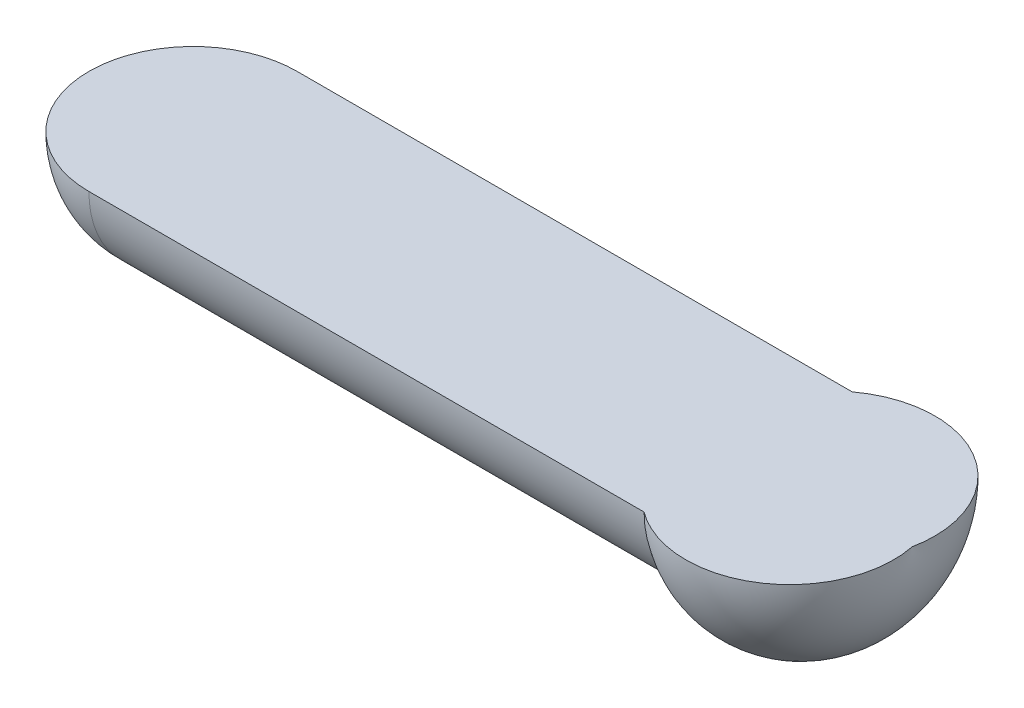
ISO-10303-21;
HEADER;
FILE_DESCRIPTION(('STEP AP214'),'2;1');
FILE_NAME('part.step','',(''),(''),'','','');
FILE_SCHEMA(('AUTOMOTIVE_DESIGN { 1 0 10303 214 1 1 1 1 }'));
ENDSEC;
DATA;
#1=APPLICATION_CONTEXT('core data for automotive mechanical design processes');
#2=APPLICATION_PROTOCOL_DEFINITION('international standard','automotive_design',2000,#1);
#3=PRODUCT_CONTEXT('',#1,'mechanical');
#4=PRODUCT('Part','Part','',(#3));
#5=PRODUCT_RELATED_PRODUCT_CATEGORY('part','',(#4));
#6=PRODUCT_DEFINITION_FORMATION('','',#4);
#7=PRODUCT_DEFINITION_CONTEXT('part definition',#1,'design');
#8=PRODUCT_DEFINITION('design','',#6,#7);
#9=PRODUCT_DEFINITION_SHAPE('','',#8);
#10=(LENGTH_UNIT() NAMED_UNIT(*) SI_UNIT(.MILLI.,.METRE.));
#11=(NAMED_UNIT(*) PLANE_ANGLE_UNIT() SI_UNIT($,.RADIAN.));
#12=(NAMED_UNIT(*) SI_UNIT($,.STERADIAN.) SOLID_ANGLE_UNIT());
#13=UNCERTAINTY_MEASURE_WITH_UNIT(LENGTH_MEASURE(1.E-05),#10,'distance_accuracy_value','');
#14=(GEOMETRIC_REPRESENTATION_CONTEXT(3) GLOBAL_UNCERTAINTY_ASSIGNED_CONTEXT((#13)) GLOBAL_UNIT_ASSIGNED_CONTEXT((#10,
#11,#12)) REPRESENTATION_CONTEXT('',''));
#15=CARTESIAN_POINT('',(0.,0.,0.));
#16=DIRECTION('',(0.,0.,1.));
#17=DIRECTION('',(1.,0.,0.));
#18=AXIS2_PLACEMENT_3D('',#15,#16,#17);
#19=CARTESIAN_POINT('',(5.40301163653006,1.84150000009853,0.584190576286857));
#20=CARTESIAN_POINT('',(5.49711891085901,1.84150000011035,0.654279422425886));
#21=CARTESIAN_POINT('',(5.60811676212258,1.84150000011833,0.701685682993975));
#22=CARTESIAN_POINT('',(5.72919004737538,1.84150000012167,0.721321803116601));
#23=CARTESIAN_POINT('',(5.85139570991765,1.84150000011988,0.710833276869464));
#24=CARTESIAN_POINT('',(6.07988301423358,1.84150000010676,0.632959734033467));
#25=CARTESIAN_POINT('',(6.24781013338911,1.84150000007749,0.45954239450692));
#26=CARTESIAN_POINT('',(6.30943488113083,1.84150000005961,0.353501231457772));
#27=CARTESIAN_POINT('',(6.34334261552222,1.84150000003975,0.235624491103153));
#28=CARTESIAN_POINT('',(6.34782944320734,1.8415000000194,0.11501524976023));
#29=CARTESIAN_POINT('',(6.3246,1.8415,0.));
#30=CARTESIAN_POINT('',(5.40301163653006,1.72526383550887,0.584194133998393));
#31=CARTESIAN_POINT('',(5.497118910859,1.71131828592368,0.654283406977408));
#32=CARTESIAN_POINT('',(5.60811676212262,1.70188588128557,0.701689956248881));
#33=CARTESIAN_POINT('',(5.72919004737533,1.69797889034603,0.721326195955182));
#34=CARTESIAN_POINT('',(5.8513957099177,1.70006578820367,0.710837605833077));
#35=CARTESIAN_POINT('',(6.07988301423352,1.7155602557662,0.632963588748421));
#36=CARTESIAN_POINT('',(6.24781013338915,1.7500650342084,0.459545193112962));
#37=CARTESIAN_POINT('',(6.30943488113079,1.77116400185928,0.353503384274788));
#38=CARTESIAN_POINT('',(6.34334261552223,1.79461788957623,0.235625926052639));
#39=CARTESIAN_POINT('',(6.34782944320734,1.81861546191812,0.115015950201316));
#40=CARTESIAN_POINT('',(6.3246,1.8415,0.));
#41=CARTESIAN_POINT('',(5.40301163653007,1.60902787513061,0.555287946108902));
#42=CARTESIAN_POINT('',(5.49711891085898,1.58113680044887,0.621909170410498));
#43=CARTESIAN_POINT('',(5.60811676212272,1.56227200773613,0.666970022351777));
#44=CARTESIAN_POINT('',(5.72919004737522,1.55445803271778,0.685634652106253));
#45=CARTESIAN_POINT('',(5.8513957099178,1.55863182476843,0.675665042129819));
#46=CARTESIAN_POINT('',(6.07988301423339,1.58962073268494,0.601644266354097));
#47=CARTESIAN_POINT('',(6.24781013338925,1.65863022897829,0.436806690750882));
#48=CARTESIAN_POINT('',(6.30943488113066,1.70082812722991,0.336011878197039));
#49=CARTESIAN_POINT('',(6.34334261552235,1.74773586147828,0.223967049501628));
#50=CARTESIAN_POINT('',(6.34782944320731,1.79573096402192,0.109324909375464));
#51=CARTESIAN_POINT('',(6.3246,1.8415,0.));
#52=CARTESIAN_POINT('',(5.40301163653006,1.50239719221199,0.497413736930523));
#53=CARTESIAN_POINT('',(5.49711891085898,1.46171299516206,0.557091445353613));
#54=CARTESIAN_POINT('',(5.60811676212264,1.43419526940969,0.597455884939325));
#55=CARTESIAN_POINT('',(5.7291900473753,1.42279716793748,0.614175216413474));
#56=CARTESIAN_POINT('',(5.85139570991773,1.42888540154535,0.605244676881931));
#57=CARTESIAN_POINT('',(6.07988301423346,1.474088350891,0.538938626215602));
#58=CARTESIAN_POINT('',(6.24781013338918,1.57475123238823,0.391281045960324));
#59=CARTESIAN_POINT('',(6.3094348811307,1.6363045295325,0.300991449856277));
#60=CARTESIAN_POINT('',(6.34334261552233,1.70472797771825,0.200624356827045));
#61=CARTESIAN_POINT('',(6.34782944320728,1.77473755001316,0.0979306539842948));
#62=CARTESIAN_POINT('',(6.3246,1.8415,0.));
#63=CARTESIAN_POINT('',(5.40301163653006,1.31351315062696,0.320996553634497));
#64=CARTESIAN_POINT('',(5.49711891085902,1.25016740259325,0.359508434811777));
#65=CARTESIAN_POINT('',(5.60811676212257,1.20732199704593,0.385556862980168));
#66=CARTESIAN_POINT('',(5.7291900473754,1.1895750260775,0.396346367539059));
#67=CARTESIAN_POINT('',(5.85139570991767,1.19905447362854,0.390583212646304));
#68=CARTESIAN_POINT('',(6.0798830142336,1.26943596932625,0.347793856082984));
#69=CARTESIAN_POINT('',(6.2478101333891,1.42616919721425,0.252505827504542));
#70=CARTESIAN_POINT('',(6.30943488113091,1.52200836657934,0.19423914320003));
#71=CARTESIAN_POINT('',(6.34334261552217,1.62854443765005,0.129469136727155));
#72=CARTESIAN_POINT('',(6.3478294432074,1.73755012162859,0.0631976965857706));
#73=CARTESIAN_POINT('',(6.3246,1.8415,0.));
#74=CARTESIAN_POINT('',(5.40301163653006,1.23741956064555,0.0713238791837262));
#75=CARTESIAN_POINT('',(5.49711891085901,1.16494440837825,0.0798810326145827));
#76=CARTESIAN_POINT('',(5.60811676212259,1.11592411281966,0.0856688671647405));
#77=CARTESIAN_POINT('',(5.72919004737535,1.09561944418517,0.0880662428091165));
#78=CARTESIAN_POINT('',(5.8513957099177,1.10646507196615,0.0867856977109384));
#79=CARTESIAN_POINT('',(6.07988301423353,1.18698996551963,0.0772781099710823));
#80=CARTESIAN_POINT('',(6.24781013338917,1.3663116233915,0.0561055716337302));
#81=CARTESIAN_POINT('',(6.30943488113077,1.47596315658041,0.0431589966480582));
#82=CARTESIAN_POINT('',(6.34334261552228,1.59785323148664,0.028767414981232));
#83=CARTESIAN_POINT('',(6.34782944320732,1.72256884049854,0.0140422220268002));
#84=CARTESIAN_POINT('',(6.3246,1.8415,0.));
#85=CARTESIAN_POINT('',(5.40301163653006,1.23741956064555,-0.0713238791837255));
#86=CARTESIAN_POINT('',(5.49711891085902,1.16494440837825,-0.079881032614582));
#87=CARTESIAN_POINT('',(5.60811676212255,1.11592411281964,-0.0856688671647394));
#88=CARTESIAN_POINT('',(5.72919004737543,1.09561944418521,-0.0880662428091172));
#89=CARTESIAN_POINT('',(5.85139570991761,1.10646507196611,-0.0867856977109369));
#90=CARTESIAN_POINT('',(6.07988301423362,1.18698996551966,-0.0772781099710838));
#91=CARTESIAN_POINT('',(6.24781013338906,1.36631162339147,-0.0561055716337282));
#92=CARTESIAN_POINT('',(6.30943488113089,1.47596315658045,-0.0431589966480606));
#93=CARTESIAN_POINT('',(6.34334261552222,1.59785323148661,-0.0287674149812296));
#94=CARTESIAN_POINT('',(6.34782944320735,1.72256884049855,-0.0140422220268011));
#95=CARTESIAN_POINT('',(6.3246,1.8415,0.));
#96=CARTESIAN_POINT('',(5.40301163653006,1.3135131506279,-0.320996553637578));
#97=CARTESIAN_POINT('',(5.49711891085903,1.25016740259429,-0.359508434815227));
#98=CARTESIAN_POINT('',(5.60811676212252,1.20732199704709,-0.38555686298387));
#99=CARTESIAN_POINT('',(5.72919004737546,1.18957502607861,-0.396346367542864));
#100=CARTESIAN_POINT('',(5.85139570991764,1.19905447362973,-0.390583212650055));
#101=CARTESIAN_POINT('',(6.07988301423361,1.2694359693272,-0.347793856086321));
#102=CARTESIAN_POINT('',(6.2478101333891,1.42616919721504,-0.252505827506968));
#103=CARTESIAN_POINT('',(6.3094348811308,1.52200836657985,-0.194239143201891));
#104=CARTESIAN_POINT('',(6.34334261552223,1.62854443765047,-0.1294691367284));
#105=CARTESIAN_POINT('',(6.34782944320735,1.73755012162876,-0.0631976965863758));
#106=CARTESIAN_POINT('',(6.3246,1.8415,0.));
#107=CARTESIAN_POINT('',(5.40301163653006,1.50239719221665,-0.497413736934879));
#108=CARTESIAN_POINT('',(5.49711891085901,1.46171299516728,-0.557091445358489));
#109=CARTESIAN_POINT('',(5.60811676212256,1.43419526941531,-0.597455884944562));
#110=CARTESIAN_POINT('',(5.72919004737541,1.42279716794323,-0.614175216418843));
#111=CARTESIAN_POINT('',(5.85139570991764,1.42888540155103,-0.605244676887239));
#112=CARTESIAN_POINT('',(6.07988301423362,1.47408835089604,-0.538938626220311));
#113=CARTESIAN_POINT('',(6.2478101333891,1.57475123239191,-0.391281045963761));
#114=CARTESIAN_POINT('',(6.30943488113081,1.63630452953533,-0.3009914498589));
#115=CARTESIAN_POINT('',(6.3433426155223,1.70472797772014,-0.20062435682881));
#116=CARTESIAN_POINT('',(6.3478294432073,1.77473755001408,-0.0979306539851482));
#117=CARTESIAN_POINT('',(6.3246,1.8415,0.));
#118=CARTESIAN_POINT('',(5.40301163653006,1.60902787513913,-0.555287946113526));
#119=CARTESIAN_POINT('',(5.49711891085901,1.58113680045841,-0.621909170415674));
#120=CARTESIAN_POINT('',(5.60811676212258,1.56227200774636,-0.666970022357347));
#121=CARTESIAN_POINT('',(5.72919004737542,1.55445803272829,-0.685634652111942));
#122=CARTESIAN_POINT('',(5.85139570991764,1.5586318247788,-0.675665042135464));
#123=CARTESIAN_POINT('',(6.07988301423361,1.58962073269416,-0.601644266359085));
#124=CARTESIAN_POINT('',(6.2478101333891,1.658630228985,-0.436806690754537));
#125=CARTESIAN_POINT('',(6.30943488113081,1.70082812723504,-0.336011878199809));
#126=CARTESIAN_POINT('',(6.34334261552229,1.74773586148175,-0.223967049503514));
#127=CARTESIAN_POINT('',(6.34782944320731,1.79573096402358,-0.109324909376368));
#128=CARTESIAN_POINT('',(6.3246,1.8415,0.));
#129=CARTESIAN_POINT('',(5.40301163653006,1.72526383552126,-0.584194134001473));
#130=CARTESIAN_POINT('',(5.49711891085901,1.71131828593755,-0.654283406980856));
#131=CARTESIAN_POINT('',(5.60811676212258,1.70188588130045,-0.701689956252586));
#132=CARTESIAN_POINT('',(5.72919004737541,1.69797889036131,-0.721326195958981));
#133=CARTESIAN_POINT('',(5.85139570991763,1.70006578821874,-0.71083760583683));
#134=CARTESIAN_POINT('',(6.07988301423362,1.71556025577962,-0.632963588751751));
#135=CARTESIAN_POINT('',(6.2478101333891,1.75006503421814,-0.459545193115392));
#136=CARTESIAN_POINT('',(6.30943488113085,1.77116400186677,-0.353503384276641));
#137=CARTESIAN_POINT('',(6.34334261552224,1.79461788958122,-0.23562592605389));
#138=CARTESIAN_POINT('',(6.34782944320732,1.81861546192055,-0.11501595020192));
#139=CARTESIAN_POINT('',(6.3246,1.8415,0.));
#140=CARTESIAN_POINT('',(5.40301163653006,1.84150000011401,-0.584190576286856));
#141=CARTESIAN_POINT('',(5.49711891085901,1.84150000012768,-0.654279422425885));
#142=CARTESIAN_POINT('',(5.60811676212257,1.84150000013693,-0.701685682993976));
#143=CARTESIAN_POINT('',(5.7291900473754,1.84150000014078,-0.721321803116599));
#144=CARTESIAN_POINT('',(5.85139570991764,1.84150000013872,-0.710833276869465));
#145=CARTESIAN_POINT('',(6.07988301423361,1.84150000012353,-0.632959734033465));
#146=CARTESIAN_POINT('',(6.2478101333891,1.84150000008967,-0.459542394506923));
#147=CARTESIAN_POINT('',(6.30943488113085,1.84150000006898,-0.353501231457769));
#148=CARTESIAN_POINT('',(6.34334261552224,1.84150000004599,-0.235624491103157));
#149=CARTESIAN_POINT('',(6.34782944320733,1.84150000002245,-0.115015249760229));
#150=CARTESIAN_POINT('',(6.3246,1.8415,0.));
#151=B_SPLINE_SURFACE_WITH_KNOTS('',5,6,((#19,#20,#21,#22,#23,#24,#25,#26,#27,#28,#29),(#30,#31,
#32,#33,#34,#35,#36,#37,#38,#39,#40),(#41,#42,#43,#44,#45,#46,#47,#48,#49,#50,#51),(#52,#53,#54,
#55,#56,#57,#58,#59,#60,#61,#62),(#63,#64,#65,#66,#67,#68,#69,#70,#71,#72,#73),(#74,#75,#76,#77,
#78,#79,#80,#81,#82,#83,#84),(#85,#86,#87,#88,#89,#90,#91,#92,#93,#94,#95),(#96,#97,#98,#99,
#100,#101,#102,#103,#104,#105,#106),(#107,#108,#109,#110,#111,#112,#113,#114,#115,#116,#117),
(#118,#119,#120,#121,#122,#123,#124,#125,#126,#127,#128),(#129,#130,#131,#132,#133,#134,#135,
#136,#137,#138,#139),(#140,#141,#142,#143,#144,#145,#146,#147,#148,#149,#150)),.UNSPECIFIED.,
.F.,.F.,.F.,(6,3,3,6),(7,4,7),(1.57079664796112,2.56563400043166,3.71755130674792,
4.71238865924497),(5.64303537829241,6.848168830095,8.053276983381),.UNSPECIFIED.);
#152=CARTESIAN_POINT('',(6.3246,1.8415,0.));
#153=CARTESIAN_POINT('',(6.32576151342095,1.84150000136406,0.00575081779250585));
#154=CARTESIAN_POINT('',(6.32683635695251,1.84150009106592,0.011519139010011));
#155=CARTESIAN_POINT('',(6.32881183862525,1.84150039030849,0.0230855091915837));
#156=CARTESIAN_POINT('',(6.32971247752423,1.84150059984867,0.0288835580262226));
#157=CARTESIAN_POINT('',(6.33133869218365,1.84150108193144,0.0405041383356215));
#158=CARTESIAN_POINT('',(6.33206426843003,1.84150135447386,0.0463266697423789));
#159=CARTESIAN_POINT('',(6.33333970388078,1.8415019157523,0.0579909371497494));
#160=CARTESIAN_POINT('',(6.3338895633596,1.84150220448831,0.0638326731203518));
#161=CARTESIAN_POINT('',(6.33481306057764,1.84150275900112,0.0755300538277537));
#162=CARTESIAN_POINT('',(6.33518669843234,1.84150302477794,0.0813856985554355));
#163=CARTESIAN_POINT('',(6.33575741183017,1.84150350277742,0.0931055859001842));
#164=CARTESIAN_POINT('',(6.33595448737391,1.84150371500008,0.0989698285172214));
#165=CARTESIAN_POINT('',(6.33617189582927,1.84150406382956,0.110701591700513));
#166=CARTESIAN_POINT('',(6.33619222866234,1.84150420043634,0.116569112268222));
#167=CARTESIAN_POINT('',(6.33605613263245,1.8415043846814,0.128302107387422));
#168=CARTESIAN_POINT('',(6.33589970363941,1.84150443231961,0.134167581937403));
#169=CARTESIAN_POINT('',(6.33541022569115,1.84150443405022,0.145891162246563));
#170=CARTESIAN_POINT('',(6.33507717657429,1.84150438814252,0.151749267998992));
#171=CARTESIAN_POINT('',(6.3342347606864,1.84150420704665,0.163452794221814));
#172=CARTESIAN_POINT('',(6.33372539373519,1.84150407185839,0.169298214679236));
#173=CARTESIAN_POINT('',(6.33253080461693,1.8415037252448,0.180971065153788));
#174=CARTESIAN_POINT('',(6.331845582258,1.84150351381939,0.186798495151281));
#175=CARTESIAN_POINT('',(6.33029990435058,1.84150303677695,0.198430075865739));
#176=CARTESIAN_POINT('',(6.32943944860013,1.84150277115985,0.204234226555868));
#177=CARTESIAN_POINT('',(6.32754408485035,1.8415022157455,0.215813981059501));
#178=CARTESIAN_POINT('',(6.32650917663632,1.84150192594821,0.221589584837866));
#179=CARTESIAN_POINT('',(6.32426584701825,1.84150136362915,0.233107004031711));
#180=CARTESIAN_POINT('',(6.32305742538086,1.8415010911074,0.238848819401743));
#181=CARTESIAN_POINT('',(6.32046816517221,1.84150060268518,0.250293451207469));
#182=CARTESIAN_POINT('',(6.31908732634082,1.84150038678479,0.255996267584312));
#183=CARTESIAN_POINT('',(6.31615448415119,1.84150009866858,0.267357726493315));
#184=CARTESIAN_POINT('',(6.31460248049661,1.84150002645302,0.27301636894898));
#185=CARTESIAN_POINT('',(6.31132872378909,1.84149997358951,0.284284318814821));
#186=CARTESIAN_POINT('',(6.30960697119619,1.84149999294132,0.289893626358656));
#187=CARTESIAN_POINT('',(6.30599528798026,1.84150000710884,0.30105779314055));
#188=CARTESIAN_POINT('',(6.30410535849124,1.84150000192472,0.306612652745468));
#189=CARTESIAN_POINT('',(6.3001590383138,1.84149999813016,0.317662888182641));
#190=CARTESIAN_POINT('',(6.29810264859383,1.84149999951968,0.323158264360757));
#191=CARTESIAN_POINT('',(6.29382527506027,1.84150000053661,0.33408455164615));
#192=CARTESIAN_POINT('',(6.291604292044,1.84150000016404,0.339515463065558));
#193=CARTESIAN_POINT('',(6.28699974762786,1.84149999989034,0.350307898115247));
#194=CARTESIAN_POINT('',(6.28461618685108,1.84149999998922,0.355669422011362));
#195=CARTESIAN_POINT('',(6.27968864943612,1.84150000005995,0.366318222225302));
#196=CARTESIAN_POINT('',(6.27714467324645,1.84150000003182,0.371605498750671));
#197=CARTESIAN_POINT('',(6.27189861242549,1.84150000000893,0.382101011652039));
#198=CARTESIAN_POINT('',(6.26919652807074,1.84150000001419,0.387309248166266));
#199=CARTESIAN_POINT('',(6.2636367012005,1.84150000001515,0.397641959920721));
#200=CARTESIAN_POINT('',(6.26077895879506,1.84150000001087,0.40276643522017));
#201=CARTESIAN_POINT('',(6.25491040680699,1.84150000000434,0.412926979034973));
#202=CARTESIAN_POINT('',(6.25189959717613,1.8415000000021,0.417963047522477));
#203=CARTESIAN_POINT('',(6.24572764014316,1.84149999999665,0.427942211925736));
#204=CARTESIAN_POINT('',(6.24256649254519,1.84149999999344,0.432885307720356));
#205=CARTESIAN_POINT('',(6.23609672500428,1.84149999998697,0.442674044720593));
#206=CARTESIAN_POINT('',(6.2327881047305,1.84149999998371,0.447519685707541));
#207=CARTESIAN_POINT('',(6.22602639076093,1.84149999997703,0.457109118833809));
#208=CARTESIAN_POINT('',(6.22257329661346,1.8414999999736,0.461852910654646));
#209=CARTESIAN_POINT('',(6.21552576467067,1.84149999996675,0.471234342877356));
#210=CARTESIAN_POINT('',(6.21193132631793,1.84149999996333,0.475871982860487));
#211=CARTESIAN_POINT('',(6.20460436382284,1.84149999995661,0.48503690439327));
#212=CARTESIAN_POINT('',(6.20087183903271,1.84149999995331,0.489564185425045));
#213=CARTESIAN_POINT('',(6.19327208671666,1.84149999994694,0.498504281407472));
#214=CARTESIAN_POINT('',(6.18940485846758,1.84149999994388,0.502917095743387));
#215=CARTESIAN_POINT('',(6.18153920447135,1.84149999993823,0.511624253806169));
#216=CARTESIAN_POINT('',(6.17754077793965,1.84149999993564,0.51591859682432));
#217=CARTESIAN_POINT('',(6.16941638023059,1.84149999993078,0.524384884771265));
#218=CARTESIAN_POINT('',(6.16529040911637,1.84149999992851,0.528556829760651));
#219=CARTESIAN_POINT('',(6.15691469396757,1.841499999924,0.536774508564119));
#220=CARTESIAN_POINT('',(6.15266495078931,1.84149999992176,0.540820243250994));
#221=CARTESIAN_POINT('',(6.14404554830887,1.84149999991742,0.548781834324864));
#222=CARTESIAN_POINT('',(6.13967588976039,1.84149999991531,0.552697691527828));
#223=CARTESIAN_POINT('',(6.13082062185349,1.84149999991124,0.560395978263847));
#224=CARTESIAN_POINT('',(6.12633501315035,1.84149999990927,0.564178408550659));
#225=CARTESIAN_POINT('',(6.11725191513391,1.84149999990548,0.57160641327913));
#226=CARTESIAN_POINT('',(6.1126544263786,1.84149999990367,0.575251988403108));
#227=CARTESIAN_POINT('',(6.10335173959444,1.84149999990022,0.582402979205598));
#228=CARTESIAN_POINT('',(6.0986465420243,1.84149999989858,0.585908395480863));
#229=CARTESIAN_POINT('',(6.08913270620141,1.84149999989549,0.592775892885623));
#230=CARTESIAN_POINT('',(6.08432406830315,1.84149999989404,0.596137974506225));
#231=CARTESIAN_POINT('',(6.07460771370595,1.84149999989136,0.60271575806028));
#232=CARTESIAN_POINT('',(6.06969999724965,1.84149999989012,0.60593146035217));
#233=CARTESIAN_POINT('',(6.05978993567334,1.84149999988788,0.612213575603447));
#234=CARTESIAN_POINT('',(6.05478759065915,1.84149999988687,0.615279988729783));
#235=CARTESIAN_POINT('',(6.04469279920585,1.84149999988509,0.621260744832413));
#236=CARTESIAN_POINT('',(6.03960035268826,1.84149999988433,0.624175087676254));
#237=CARTESIAN_POINT('',(6.02932996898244,1.84149999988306,0.629849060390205));
#238=CARTESIAN_POINT('',(6.02415203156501,1.84149999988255,0.632608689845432));
#239=CARTESIAN_POINT('',(6.01371535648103,1.84149999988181,0.637970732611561));
#240=CARTESIAN_POINT('',(6.00845661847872,1.84149999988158,0.64057314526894));
#241=CARTESIAN_POINT('',(5.9978631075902,1.84149999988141,0.645618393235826));
#242=CARTESIAN_POINT('',(5.99252833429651,1.84149999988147,0.648061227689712));
#243=CARTESIAN_POINT('',(5.9817875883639,1.84149999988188,0.652785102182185));
#244=CARTESIAN_POINT('',(5.97638161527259,1.84149999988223,0.65506614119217));
#245=CARTESIAN_POINT('',(5.96550337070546,1.84149999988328,0.65946435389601));
#246=CARTESIAN_POINT('',(5.96003109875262,1.84149999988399,0.661581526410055));
#247=CARTESIAN_POINT('',(5.94902521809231,1.84149999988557,0.665650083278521));
#248=CARTESIAN_POINT('',(5.94349160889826,1.84149999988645,0.667601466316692));
#249=CARTESIAN_POINT('',(5.93236811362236,1.84149999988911,0.67133665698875));
#250=CARTESIAN_POINT('',(5.92677822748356,1.84149999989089,0.673120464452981));
#251=CARTESIAN_POINT('',(5.91554729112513,1.84149999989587,0.676518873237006));
#252=CARTESIAN_POINT('',(5.90990624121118,1.84149999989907,0.678133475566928));
#253=CARTESIAN_POINT('',(5.89857809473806,1.84149999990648,0.681192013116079));
#254=CARTESIAN_POINT('',(5.89289099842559,1.84149999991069,0.68263594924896));
#255=CARTESIAN_POINT('',(5.88147591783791,1.84149999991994,0.6853518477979));
#256=CARTESIAN_POINT('',(5.8757479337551,1.84149999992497,0.686623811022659));
#257=CARTESIAN_POINT('',(5.86425627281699,1.84149999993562,0.688994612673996));
#258=CARTESIAN_POINT('',(5.85849259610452,1.84149999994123,0.690093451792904));
#259=CARTESIAN_POINT('',(5.84693477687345,1.84149999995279,0.692117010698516));
#260=CARTESIAN_POINT('',(5.84114063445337,1.84149999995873,0.693041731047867));
#261=CARTESIAN_POINT('',(5.82952713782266,1.84149999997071,0.694716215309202));
#262=CARTESIAN_POINT('',(5.8237077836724,1.84149999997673,0.695465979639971));
#263=CARTESIAN_POINT('',(5.8120491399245,1.84149999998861,0.696789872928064));
#264=CARTESIAN_POINT('',(5.80620985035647,1.84149999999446,0.697364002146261));
#265=CARTESIAN_POINT('',(5.7945166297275,1.84150000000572,0.698336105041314));
#266=CARTESIAN_POINT('',(5.78866269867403,1.84150000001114,0.698734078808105));
#267=CARTESIAN_POINT('',(5.77694550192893,1.84150000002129,0.699353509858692));
#268=CARTESIAN_POINT('',(5.77108223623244,1.84150000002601,0.699574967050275));
#269=CARTESIAN_POINT('',(5.7593516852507,1.84150000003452,0.699841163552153));
#270=CARTESIAN_POINT('',(5.75348439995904,1.84150000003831,0.699885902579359));
#271=CARTESIAN_POINT('',(5.74175112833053,1.84150000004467,0.699798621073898));
#272=CARTESIAN_POINT('',(5.73588514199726,1.84150000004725,0.699666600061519));
#273=CARTESIAN_POINT('',(5.72415978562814,1.84150000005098,0.699225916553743));
#274=CARTESIAN_POINT('',(5.7183004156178,1.84150000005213,0.698917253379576));
#275=CARTESIAN_POINT('',(5.70659360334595,1.8415000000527,0.698123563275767));
#276=CARTESIAN_POINT('',(5.70074616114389,1.84150000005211,0.697638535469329));
#277=CARTESIAN_POINT('',(5.68906850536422,1.84150000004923,0.696492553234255));
#278=CARTESIAN_POINT('',(5.68323829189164,1.84150000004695,0.695831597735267));
#279=CARTESIAN_POINT('',(5.67160037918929,1.84150000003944,0.694334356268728));
#280=CARTESIAN_POINT('',(5.66579268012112,1.84150000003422,0.693498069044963));
#281=CARTESIAN_POINT('',(5.65420509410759,1.84150000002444,0.691650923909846));
#282=CARTESIAN_POINT('',(5.64842520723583,1.84150000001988,0.690640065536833));
#283=CARTESIAN_POINT('',(5.63689852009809,1.84150000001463,0.688444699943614));
#284=CARTESIAN_POINT('',(5.63115171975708,1.84150000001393,0.687260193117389));
#285=CARTESIAN_POINT('',(5.61969641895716,1.84150000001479,0.684718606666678));
#286=CARTESIAN_POINT('',(5.61398791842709,1.84150000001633,0.683361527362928));
#287=CARTESIAN_POINT('',(5.60261439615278,1.84150000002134,0.680476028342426));
#288=CARTESIAN_POINT('',(5.59694937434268,1.8415000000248,0.678947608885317));
#289=CARTESIAN_POINT('',(5.58566794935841,1.84150000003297,0.675720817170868));
#290=CARTESIAN_POINT('',(5.58005154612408,1.84150000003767,0.674022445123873));
#291=CARTESIAN_POINT('',(5.5688724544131,1.84150000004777,0.670457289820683));
#292=CARTESIAN_POINT('',(5.56330976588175,1.84150000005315,0.668590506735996));
#293=CARTESIAN_POINT('',(5.55224315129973,1.84150000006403,0.664690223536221));
#294=CARTESIAN_POINT('',(5.54673922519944,1.84150000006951,0.662656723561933));
#295=CARTESIAN_POINT('',(5.53579513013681,1.84150000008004,0.658424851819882));
#296=CARTESIAN_POINT('',(5.53035496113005,1.84150000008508,0.656226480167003));
#297=CARTESIAN_POINT('',(5.51954331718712,1.84150000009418,0.651666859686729));
#298=CARTESIAN_POINT('',(5.5141718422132,1.84150000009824,0.649305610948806));
#299=CARTESIAN_POINT('',(5.50350246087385,1.84150000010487,0.644422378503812));
#300=CARTESIAN_POINT('',(5.49820455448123,1.84150000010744,0.641900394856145));
#301=CARTESIAN_POINT('',(5.48768711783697,1.84150000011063,0.636697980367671));
#302=CARTESIAN_POINT('',(5.48246758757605,1.84150000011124,0.634017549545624));
#303=CARTESIAN_POINT('',(5.47211163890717,1.84150000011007,0.628500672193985));
#304=CARTESIAN_POINT('',(5.46697522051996,1.84150000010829,0.62566422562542));
#305=CARTESIAN_POINT('',(5.45679015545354,1.84150000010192,0.619837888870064));
#306=CARTESIAN_POINT('',(5.45174150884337,1.84150000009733,0.616847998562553));
#307=CARTESIAN_POINT('',(5.44173656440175,1.841500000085,0.610717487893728));
#308=CARTESIAN_POINT('',(5.43678026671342,1.84150000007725,0.607576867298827));
#309=CARTESIAN_POINT('',(5.426964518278,1.84150000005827,0.601147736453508));
#310=CARTESIAN_POINT('',(5.42210506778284,1.84150000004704,0.597859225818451));
#311=CARTESIAN_POINT('',(5.41248739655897,1.84150000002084,0.591137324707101));
#312=CARTESIAN_POINT('',(5.40772917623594,1.84150000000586,0.587703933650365));
#313=CARTESIAN_POINT('',(5.40302377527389,1.84149999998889,0.584199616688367));
#314=B_SPLINE_CURVE_WITH_KNOTS('',3,(#152,#153,#154,#155,#156,#157,#158,#159,#160,#161,#162,
#163,#164,#165,#166,#167,#168,#169,#170,#171,#172,#173,#174,#175,#176,#177,#178,#179,#180,#181,
#182,#183,#184,#185,#186,#187,#188,#189,#190,#191,#192,#193,#194,#195,#196,#197,#198,#199,#200,
#201,#202,#203,#204,#205,#206,#207,#208,#209,#210,#211,#212,#213,#214,#215,#216,#217,#218,#219,
#220,#221,#222,#223,#224,#225,#226,#227,#228,#229,#230,#231,#232,#233,#234,#235,#236,#237,#238,
#239,#240,#241,#242,#243,#244,#245,#246,#247,#248,#249,#250,#251,#252,#253,#254,#255,#256,#257,
#258,#259,#260,#261,#262,#263,#264,#265,#266,#267,#268,#269,#270,#271,#272,#273,#274,#275,#276,
#277,#278,#279,#280,#281,#282,#283,#284,#285,#286,#287,#288,#289,#290,#291,#292,#293,#294,#295,
#296,#297,#298,#299,#300,#301,#302,#303,#304,#305,#306,#307,#308,#309,#310,#311,#312,#313),
.UNSPECIFIED.,.F.,.F.,(4,2,2,2,2,2,2,2,2,2,2,2,2,2,2,2,2,2,2,2,2,2,2,2,2,2,2,2,2,2,2,2,2,2,2,2,
2,2,2,2,2,2,2,2,2,2,2,2,2,2,2,2,2,2,2,2,2,2,2,2,2,2,2,2,2,2,2,2,2,2,2,2,2,2,2,2,2,2,2,2,4),(0.,
0.0176001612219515,0.0352002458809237,0.0528002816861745,0.0704002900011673,0.0880002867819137,
0.105600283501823,0.123200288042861,0.140800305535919,0.158400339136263,0.176000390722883,
0.193600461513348,0.211200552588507,0.228800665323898,0.246400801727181,0.264000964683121,
0.281601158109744,0.299201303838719,0.316801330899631,0.334401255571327,0.352001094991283,
0.369600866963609,0.387200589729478,0.404800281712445,0.422399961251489,0.439999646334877,
0.457599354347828,0.475199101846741,0.492798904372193,0.510398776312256,0.527998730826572,
0.545598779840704,0.563198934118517,0.580799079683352,0.598399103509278,0.615999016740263,
0.633598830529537,0.651198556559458,0.668798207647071,0.686397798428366,0.703997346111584,
0.721596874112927,0.739196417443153,0.756796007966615,0.774395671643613,0.791995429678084,
0.80959529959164,0.827195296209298,0.844795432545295,0.862395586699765,0.87999563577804,
0.897595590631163,0.915195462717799,0.932795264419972,0.950395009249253,0.967994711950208,
0.985594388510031,1.00319405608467,1.0207937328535,1.03839343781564,1.05599319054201,
1.07359301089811,1.09119291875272,1.10879293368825,1.12639307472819,1.14399326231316,
1.16159340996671,1.17919352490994,1.19679361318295,1.21439367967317,1.23199372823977,
1.24959376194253,1.26719378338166,1.28479379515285,1.3023938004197,1.31999380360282,
1.33759381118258,1.35519383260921,1.37279388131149,1.39039397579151,1.40799414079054),.UNSPECIFIED.);
#315=CARTESIAN_POINT('',(5.40302370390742,1.84149999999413,0.584199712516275));
#316=VERTEX_POINT('',#315);
#317=CARTESIAN_POINT('',(6.3246,1.8415,0.));
#318=VERTEX_POINT('',#317);
#319=EDGE_CURVE('E31',#316,#318,#314,.F.);
#320=CARTESIAN_POINT('',(5.40302377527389,1.84149999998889,0.584199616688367));
#321=CARTESIAN_POINT('',(5.40302217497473,1.83385287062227,0.58419874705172));
#322=CARTESIAN_POINT('',(5.40302079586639,1.82620576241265,0.584047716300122));
#323=CARTESIAN_POINT('',(5.4030184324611,1.81092340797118,0.583445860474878));
#324=CARTESIAN_POINT('',(5.40301744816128,1.80328816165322,0.582995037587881));
#325=CARTESIAN_POINT('',(5.40301582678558,1.78804128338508,0.58179412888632));
#326=CARTESIAN_POINT('',(5.40301518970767,1.78042965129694,0.581044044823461));
#327=CARTESIAN_POINT('',(5.40301421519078,1.76524171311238,0.579245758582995));
#328=CARTESIAN_POINT('',(5.4030138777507,1.75766540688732,0.578197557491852));
#329=CARTESIAN_POINT('',(5.40301345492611,1.74255977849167,0.575804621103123));
#330=CARTESIAN_POINT('',(5.40301336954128,1.73503045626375,0.574459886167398));
#331=CARTESIAN_POINT('',(5.40301340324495,1.72003038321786,0.571475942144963));
#332=CARTESIAN_POINT('',(5.40301352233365,1.71255963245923,0.569836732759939));
#333=CARTESIAN_POINT('',(5.40301391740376,1.69768820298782,0.566266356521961));
#334=CARTESIAN_POINT('',(5.40301419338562,1.69028752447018,0.564335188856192));
#335=CARTESIAN_POINT('',(5.40301485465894,1.6755676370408,0.560183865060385));
#336=CARTESIAN_POINT('',(5.40301523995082,1.66824842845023,0.557963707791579));
#337=CARTESIAN_POINT('',(5.40301607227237,1.65370275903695,0.553237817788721));
#338=CARTESIAN_POINT('',(5.40301651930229,1.64647629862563,0.550732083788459));
#339=CARTESIAN_POINT('',(5.40301742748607,1.63212726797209,0.545438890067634));
#340=CARTESIAN_POINT('',(5.40301788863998,1.62500469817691,0.5426514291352));
#341=CARTESIAN_POINT('',(5.4030187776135,1.61087443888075,0.536799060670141));
#342=CARTESIAN_POINT('',(5.40301920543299,1.6038667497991,0.533734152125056));
#343=CARTESIAN_POINT('',(5.40301997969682,1.58997707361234,0.527331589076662));
#344=CARTESIAN_POINT('',(5.40302032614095,1.58309508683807,0.523993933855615));
#345=CARTESIAN_POINT('',(5.40302089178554,1.56946745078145,0.517050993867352));
#346=CARTESIAN_POINT('',(5.40302111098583,1.56272180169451,0.513445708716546));
#347=CARTESIAN_POINT('',(5.40302136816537,1.54937727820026,0.505973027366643));
#348=CARTESIAN_POINT('',(5.40302140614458,1.54277840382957,0.502105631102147));
#349=CARTESIAN_POINT('',(5.40302127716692,1.52973763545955,0.494114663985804));
#350=CARTESIAN_POINT('',(5.40302111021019,1.52329574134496,0.489991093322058));
#351=CARTESIAN_POINT('',(5.40302043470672,1.51057895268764,0.481494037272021));
#352=CARTESIAN_POINT('',(5.40301992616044,1.50430405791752,0.47712055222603));
#353=CARTESIAN_POINT('',(5.40301885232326,1.4919308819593,0.468130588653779));
#354=CARTESIAN_POINT('',(5.4030182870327,1.48583259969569,0.46351411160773));
#355=CARTESIAN_POINT('',(5.40301741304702,1.47382193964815,0.454045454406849));
#356=CARTESIAN_POINT('',(5.40301710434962,1.46790956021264,0.449193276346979));
#357=CARTESIAN_POINT('',(5.40301663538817,1.45627986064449,0.439260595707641));
#358=CARTESIAN_POINT('',(5.40301647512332,1.4505625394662,0.434180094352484));
#359=CARTESIAN_POINT('',(5.40301630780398,1.43933175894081,0.423798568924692));
#360=CARTESIAN_POINT('',(5.40301630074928,1.43381829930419,0.418497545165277));
#361=CARTESIAN_POINT('',(5.4030164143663,1.42300373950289,0.407683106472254));
#362=CARTESIAN_POINT('',(5.40301653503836,1.41770263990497,0.40216969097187));
#363=CARTESIAN_POINT('',(5.40301688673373,1.40732095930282,0.390938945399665));
#364=CARTESIAN_POINT('',(5.40301711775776,1.40224037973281,0.385221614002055));
#365=CARTESIAN_POINT('',(5.40301767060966,1.39230754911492,0.373591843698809));
#366=CARTESIAN_POINT('',(5.40301799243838,1.3874553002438,0.367679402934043));
#367=CARTESIAN_POINT('',(5.40301870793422,1.37798657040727,0.355668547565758));
#368=CARTESIAN_POINT('',(5.40301910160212,1.37337009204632,0.349570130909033));
#369=CARTESIAN_POINT('',(5.4030199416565,1.36437997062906,0.337196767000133));
#370=CARTESIAN_POINT('',(5.40302038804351,1.36000633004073,0.330921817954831));
#371=CARTESIAN_POINT('',(5.40302131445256,1.35150850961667,0.318205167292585));
#372=CARTESIAN_POINT('',(5.4030217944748,1.34738433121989,0.311763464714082));
#373=CARTESIAN_POINT('',(5.40302276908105,1.33939188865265,0.298723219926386));
#374=CARTESIAN_POINT('',(5.40302326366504,1.33552362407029,0.292124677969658));
#375=CARTESIAN_POINT('',(5.40302424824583,1.32804914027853,0.278780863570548));
#376=CARTESIAN_POINT('',(5.40302473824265,1.32444291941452,0.272035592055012));
#377=CARTESIAN_POINT('',(5.40302569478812,1.31749817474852,0.258408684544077));
#378=CARTESIAN_POINT('',(5.40302616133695,1.314159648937,0.251527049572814));
#379=CARTESIAN_POINT('',(5.4030270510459,1.30775550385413,0.237637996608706));
#380=CARTESIAN_POINT('',(5.40302747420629,1.30468988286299,0.230630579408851));
#381=CARTESIAN_POINT('',(5.40302826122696,1.29883630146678,0.216500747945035));
#382=CARTESIAN_POINT('',(5.40302862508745,1.29604834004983,0.209378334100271));
#383=CARTESIAN_POINT('',(5.40302926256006,1.29075439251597,0.195029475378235));
#384=CARTESIAN_POINT('',(5.40302953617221,1.28824840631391,0.187803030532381));
#385=CARTESIAN_POINT('',(5.40303001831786,1.28352223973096,0.173257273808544));
#386=CARTESIAN_POINT('',(5.40303022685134,1.28130205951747,0.165937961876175));
#387=CARTESIAN_POINT('',(5.40303062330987,1.27715086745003,0.151217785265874));
#388=CARTESIAN_POINT('',(5.40303081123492,1.27521985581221,0.143816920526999));
#389=CARTESIAN_POINT('',(5.4030311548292,1.2716499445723,0.128945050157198));
#390=CARTESIAN_POINT('',(5.40303131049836,1.27001104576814,0.121474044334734));
#391=CARTESIAN_POINT('',(5.40303159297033,1.26702784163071,0.106473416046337));
#392=CARTESIAN_POINT('',(5.40303171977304,1.26568353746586,0.0989437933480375));
#393=CARTESIAN_POINT('',(5.40303194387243,1.26329155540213,0.0838375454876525));
#394=CARTESIAN_POINT('',(5.403032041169,1.26224387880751,0.076260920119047));
#395=CARTESIAN_POINT('',(5.40303220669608,1.26044673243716,0.061072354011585));
#396=CARTESIAN_POINT('',(5.40303227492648,1.259697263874,0.0534604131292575));
#397=CARTESIAN_POINT('',(5.40303238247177,1.25849766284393,0.0382129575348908));
#398=CARTESIAN_POINT('',(5.40303242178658,1.25804753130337,0.0305774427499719));
#399=CARTESIAN_POINT('',(5.40303247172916,1.25744728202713,0.0152946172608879));
#400=CARTESIAN_POINT('',(5.40303248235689,1.25729716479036,0.007647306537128));
#401=CARTESIAN_POINT('',(5.40303247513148,1.25729717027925,-0.00764731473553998));
#402=CARTESIAN_POINT('',(5.40303245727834,1.25744729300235,-0.015294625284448));
#403=CARTESIAN_POINT('',(5.40303239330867,1.25804755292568,-0.0305774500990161));
#404=CARTESIAN_POINT('',(5.40303234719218,1.25849768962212,-0.0382129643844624));
#405=CARTESIAN_POINT('',(5.40303222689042,1.25969730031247,-0.05346041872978));
#406=CARTESIAN_POINT('',(5.40303215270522,1.26044677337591,-0.0610723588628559));
#407=CARTESIAN_POINT('',(5.40303197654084,1.26224392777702,-0.0762609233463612));
#408=CARTESIAN_POINT('',(5.40303187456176,1.26329160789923,-0.0838375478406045));
#409=CARTESIAN_POINT('',(5.40303164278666,1.26568359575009,-0.0989437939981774));
#410=CARTESIAN_POINT('',(5.40303151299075,1.26702790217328,-0.106473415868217));
#411=CARTESIAN_POINT('',(5.40303122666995,1.27001110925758,-0.121474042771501));
#412=CARTESIAN_POINT('',(5.40303107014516,1.27165000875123,-0.128945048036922));
#413=CARTESIAN_POINT('',(5.40303072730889,1.27521991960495,-0.143816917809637));
#414=CARTESIAN_POINT('',(5.4030305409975,1.27715093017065,-0.151217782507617));
#415=CARTESIAN_POINT('',(5.40303015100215,1.28130211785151,-0.165937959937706));
#416=CARTESIAN_POINT('',(5.40302994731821,1.28352229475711,-0.173257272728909));
#417=CARTESIAN_POINT('',(5.40302947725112,1.28824845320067,-0.187803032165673));
#418=CARTESIAN_POINT('',(5.40302921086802,1.29075443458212,-0.195029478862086));
#419=CARTESIAN_POINT('',(5.40302858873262,1.29604837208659,-0.209378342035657));
#420=CARTESIAN_POINT('',(5.40302823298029,1.29883632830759,-0.216500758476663));
#421=CARTESIAN_POINT('',(5.40302746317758,1.30468989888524,-0.23063059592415));
#422=CARTESIAN_POINT('',(5.40302704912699,1.30775551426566,-0.237638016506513));
#423=CARTESIAN_POINT('',(5.40302617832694,1.31415964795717,-0.251527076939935));
#424=CARTESIAN_POINT('',(5.40302572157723,1.31749816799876,-0.258408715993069));
#425=CARTESIAN_POINT('',(5.40302478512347,1.32444290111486,-0.272035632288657));
#426=CARTESIAN_POINT('',(5.40302430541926,1.32804911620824,-0.278780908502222));
#427=CARTESIAN_POINT('',(5.40302334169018,1.33552358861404,-0.292124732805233));
#428=CARTESIAN_POINT('',(5.40302285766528,1.33939184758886,-0.298723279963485));
#429=CARTESIAN_POINT('',(5.40302190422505,1.34738427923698,-0.311763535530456));
#430=CARTESIAN_POINT('',(5.40302143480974,1.35150845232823,-0.318205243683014));
#431=CARTESIAN_POINT('',(5.4030205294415,1.36000626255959,-0.330921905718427));
#432=CARTESIAN_POINT('',(5.40302009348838,1.36437989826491,-0.337196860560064));
#433=CARTESIAN_POINT('',(5.40301927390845,1.37337001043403,-0.349570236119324));
#434=CARTESIAN_POINT('',(5.40301889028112,1.37798648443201,-0.35566865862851));
#435=CARTESIAN_POINT('',(5.40301819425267,1.38745520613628,-0.367679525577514));
#436=CARTESIAN_POINT('',(5.40301788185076,1.39230745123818,-0.373591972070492));
#437=CARTESIAN_POINT('',(5.40301734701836,1.40224027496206,-0.385221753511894));
#438=CARTESIAN_POINT('',(5.403017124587,1.40732085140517,-0.390939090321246));
#439=CARTESIAN_POINT('',(5.40301678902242,1.41770252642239,-0.402169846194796));
#440=CARTESIAN_POINT('',(5.40301667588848,1.42300362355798,-0.407683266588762));
#441=CARTESIAN_POINT('',(5.40301657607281,1.43381817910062,-0.418497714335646));
#442=CARTESIAN_POINT('',(5.40301658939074,1.43933163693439,-0.423798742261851));
#443=CARTESIAN_POINT('',(5.40301676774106,1.45056241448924,-0.434180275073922));
#444=CARTESIAN_POINT('',(5.40301693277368,1.45627973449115,-0.43926077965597));
#445=CARTESIAN_POINT('',(5.40301740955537,1.46790943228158,-0.449193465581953));
#446=CARTESIAN_POINT('',(5.40301772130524,1.47382181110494,-0.45404564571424));
#447=CARTESIAN_POINT('',(5.4030185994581,1.48583247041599,-0.463514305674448));
#448=CARTESIAN_POINT('',(5.40301916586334,1.49193075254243,-0.468130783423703));
#449=CARTESIAN_POINT('',(5.40302023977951,1.50430392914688,-0.477120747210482));
#450=CARTESIAN_POINT('',(5.40302074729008,1.51057882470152,-0.481494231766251));
#451=CARTESIAN_POINT('',(5.40302141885,1.52329561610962,-0.489991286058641));
#452=CARTESIAN_POINT('',(5.40302158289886,1.52973751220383,-0.494114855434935));
#453=CARTESIAN_POINT('',(5.40302170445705,1.54277828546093,-0.50210581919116));
#454=CARTESIAN_POINT('',(5.40302166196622,1.54937716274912,-0.505973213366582));
#455=CARTESIAN_POINT('',(5.40302139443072,1.56272169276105,-0.513445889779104));
#456=CARTESIAN_POINT('',(5.40302116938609,1.56946734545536,-0.517051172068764));
#457=CARTESIAN_POINT('',(5.40302059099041,1.58309498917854,-0.523994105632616));
#458=CARTESIAN_POINT('',(5.40302023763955,1.58997698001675,-0.527331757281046));
#459=CARTESIAN_POINT('',(5.40301944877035,1.60386666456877,-0.533734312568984));
#460=CARTESIAN_POINT('',(5.40301901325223,1.61087435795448,-0.536799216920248));
#461=CARTESIAN_POINT('',(5.40301810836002,1.62500462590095,-0.542651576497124));
#462=CARTESIAN_POINT('',(5.40301763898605,1.63212720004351,-0.545439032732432));
#463=CARTESIAN_POINT('',(5.40301671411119,1.64647623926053,-0.550732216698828));
#464=CARTESIAN_POINT('',(5.40301625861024,1.65370270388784,-0.553237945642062));
#465=CARTESIAN_POINT('',(5.40301540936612,1.66824838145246,-0.557963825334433));
#466=CARTESIAN_POINT('',(5.40301501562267,1.67556759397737,-0.560183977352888));
#467=CARTESIAN_POINT('',(5.40301433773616,1.6902874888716,-0.564335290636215));
#468=CARTESIAN_POINT('',(5.40301405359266,1.69768817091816,-0.566266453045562));
#469=CARTESIAN_POINT('',(5.40301364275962,1.71255960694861,-0.569836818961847));
#470=CARTESIAN_POINT('',(5.40301351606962,1.72003036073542,-0.57147602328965));
#471=CARTESIAN_POINT('',(5.40301346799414,1.73503043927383,-0.574459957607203));
#472=CARTESIAN_POINT('',(5.40301354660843,1.74255976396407,-0.575804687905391));
#473=CARTESIAN_POINT('',(5.40301395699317,1.75766539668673,-0.578197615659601));
#474=CARTESIAN_POINT('',(5.40301428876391,1.76524170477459,-0.579245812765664));
#475=CARTESIAN_POINT('',(5.40301525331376,1.7804296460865,-0.581044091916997));
#476=CARTESIAN_POINT('',(5.40301588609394,1.7880412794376,-0.581794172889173));
#477=CARTESIAN_POINT('',(5.40301750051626,1.80328815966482,-0.582995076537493));
#478=CARTESIAN_POINT('',(5.40301848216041,1.81092340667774,-0.583445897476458));
#479=CARTESIAN_POINT('',(5.40302084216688,1.82620576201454,-0.584047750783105));
#480=CARTESIAN_POINT('',(5.40302222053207,1.83385287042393,-0.584198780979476));
#481=CARTESIAN_POINT('',(5.4030238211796,1.84149999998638,-0.584199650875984));
#482=B_SPLINE_CURVE_WITH_KNOTS('',3,(#320,#321,#322,#323,#324,#325,#326,#327,#328,#329,#330,
#331,#332,#333,#334,#335,#336,#337,#338,#339,#340,#341,#342,#343,#344,#345,#346,#347,#348,#349,
#350,#351,#352,#353,#354,#355,#356,#357,#358,#359,#360,#361,#362,#363,#364,#365,#366,#367,#368,
#369,#370,#371,#372,#373,#374,#375,#376,#377,#378,#379,#380,#381,#382,#383,#384,#385,#386,#387,
#388,#389,#390,#391,#392,#393,#394,#395,#396,#397,#398,#399,#400,#401,#402,#403,#404,#405,#406,
#407,#408,#409,#410,#411,#412,#413,#414,#415,#416,#417,#418,#419,#420,#421,#422,#423,#424,#425,
#426,#427,#428,#429,#430,#431,#432,#433,#434,#435,#436,#437,#438,#439,#440,#441,#442,#443,#444,
#445,#446,#447,#448,#449,#450,#451,#452,#453,#454,#455,#456,#457,#458,#459,#460,#461,#462,#463,
#464,#465,#466,#467,#468,#469,#470,#471,#472,#473,#474,#475,#476,#477,#478,#479,#480,#481),
.UNSPECIFIED.,.F.,.F.,(4,2,2,2,2,2,2,2,2,2,2,2,2,2,2,2,2,2,2,2,2,2,2,2,2,2,2,2,2,2,2,2,2,2,2,2,
2,2,2,2,2,2,2,2,2,2,2,2,2,2,2,2,2,2,2,2,2,2,2,2,2,2,2,2,2,2,2,2,2,2,2,2,2,2,2,2,2,2,2,2,4),(0.,
0.0229399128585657,0.0458796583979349,0.0688192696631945,0.0917587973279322,0.114698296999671,
0.137637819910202,0.160577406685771,0.183517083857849,0.206456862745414,0.229396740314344,
0.252336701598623,0.275276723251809,0.298216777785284,0.32115683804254,0.344096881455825,
0.367036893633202,0.389976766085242,0.412916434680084,0.43585598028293,0.458795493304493,
0.481735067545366,0.504674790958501,0.527614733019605,0.550554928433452,0.573495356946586,
0.596435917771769,0.619376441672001,0.642316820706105,0.665257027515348,0.688197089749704,
0.711137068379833,0.73407704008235,0.757017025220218,0.779957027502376,0.802897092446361,
0.825837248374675,0.84877750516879,0.87171785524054,0.894658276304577,0.91759873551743,
0.940539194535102,0.96347961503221,0.986419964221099,1.00936021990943,1.03230037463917,
1.05524043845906,1.07818043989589,1.10112042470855,1.12406039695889,1.14700037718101,
1.16994044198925,1.19288065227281,1.21582103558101,1.23876156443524,1.26170213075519,
1.28464256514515,1.30758276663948,1.33052271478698,1.35346244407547,1.37640202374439,
1.39934154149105,1.42228109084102,1.44522076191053,1.46816063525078,1.49110064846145,
1.51404069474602,1.53698075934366,1.55992081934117,1.5828608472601,1.60580081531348,
1.62874069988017,1.65168048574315,1.67462016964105,1.69755976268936,1.7204992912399,
1.74343879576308,1.76637832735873,1.78931794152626,1.81225768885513,1.83519760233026),.UNSPECIFIED.);
#483=CARTESIAN_POINT('',(5.40302370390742,1.8414999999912,-0.584199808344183));
#484=VERTEX_POINT('',#483);
#485=EDGE_CURVE('E10',#316,#484,#482,.T.);
#486=CARTESIAN_POINT('',(5.4030238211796,1.84149999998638,-0.584199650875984));
#487=CARTESIAN_POINT('',(5.40772916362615,1.84150000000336,-0.587703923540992));
#488=CARTESIAN_POINT('',(5.41248732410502,1.84150000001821,-0.591137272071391));
#489=CARTESIAN_POINT('',(5.42210488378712,1.84150000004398,-0.597859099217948));
#490=CARTESIAN_POINT('',(5.42696428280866,1.84150000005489,-0.601147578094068));
#491=CARTESIAN_POINT('',(5.43677993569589,1.84150000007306,-0.607576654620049));
#492=CARTESIAN_POINT('',(5.44173618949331,1.84150000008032,-0.610717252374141));
#493=CARTESIAN_POINT('',(5.45174105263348,1.84150000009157,-0.616847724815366));
#494=CARTESIAN_POINT('',(5.45678966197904,1.84150000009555,-0.61983759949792));
#495=CARTESIAN_POINT('',(5.46697465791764,1.84150000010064,-0.625663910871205));
#496=CARTESIAN_POINT('',(5.47211104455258,1.84150000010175,-0.628500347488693));
#497=CARTESIAN_POINT('',(5.48246693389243,1.84150000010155,-0.634017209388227));
#498=CARTESIAN_POINT('',(5.48768643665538,1.84150000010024,-0.636697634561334));
#499=CARTESIAN_POINT('',(5.49820382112,1.8415000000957,-0.641900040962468));
#500=CARTESIAN_POINT('',(5.50350170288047,1.84150000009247,-0.644422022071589));
#501=CARTESIAN_POINT('',(5.51417103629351,1.84150000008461,-0.649305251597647));
#502=CARTESIAN_POINT('',(5.5195424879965,1.84150000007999,-0.651666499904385));
#503=CARTESIAN_POINT('',(5.53035408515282,1.84150000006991,-0.656226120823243));
#504=CARTESIAN_POINT('',(5.53579423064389,1.84150000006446,-0.658424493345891));
#505=CARTESIAN_POINT('',(5.5467382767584,1.84150000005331,-0.662656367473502));
#506=CARTESIAN_POINT('',(5.55224217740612,1.84150000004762,-0.664689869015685));
#507=CARTESIAN_POINT('',(5.56330873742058,1.84150000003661,-0.66859015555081));
#508=CARTESIAN_POINT('',(5.5688713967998,1.8415000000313,-0.670456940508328));
#509=CARTESIAN_POINT('',(5.58005042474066,1.84150000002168,-0.674022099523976));
#510=CARTESIAN_POINT('',(5.58566679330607,1.84150000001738,-0.675720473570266));
#511=CARTESIAN_POINT('',(5.59694814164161,1.84150000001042,-0.678947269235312));
#512=CARTESIAN_POINT('',(5.60261312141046,1.84150000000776,-0.680475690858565));
#513=CARTESIAN_POINT('',(5.61398655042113,1.84150000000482,-0.683361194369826));
#514=CARTESIAN_POINT('',(5.61969499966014,1.84150000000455,-0.684718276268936));
#515=CARTESIAN_POINT('',(5.63115018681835,1.84150000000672,-0.687259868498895));
#516=CARTESIAN_POINT('',(5.6368969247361,1.84150000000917,-0.688444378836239));
#517=CARTESIAN_POINT('',(5.64842347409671,1.84150000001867,-0.690639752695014));
#518=CARTESIAN_POINT('',(5.65420328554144,1.84150000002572,-0.691650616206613));
#519=CARTESIAN_POINT('',(5.66579073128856,1.84150000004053,-0.693497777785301));
#520=CARTESIAN_POINT('',(5.67159836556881,1.84150000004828,-0.694334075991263));
#521=CARTESIAN_POINT('',(5.68323618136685,1.84150000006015,-0.695831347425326));
#522=CARTESIAN_POINT('',(5.68906636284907,1.84150000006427,-0.696492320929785));
#523=CARTESIAN_POINT('',(5.7007439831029,1.84150000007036,-0.697638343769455));
#524=CARTESIAN_POINT('',(5.70659142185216,1.84150000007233,-0.698123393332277));
#525=CARTESIAN_POINT('',(5.71829825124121,1.84150000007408,-0.698917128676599));
#526=CARTESIAN_POINT('',(5.72415764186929,1.84150000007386,-0.699225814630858));
#527=CARTESIAN_POINT('',(5.73588305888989,1.84150000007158,-0.699666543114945));
#528=CARTESIAN_POINT('',(5.74174908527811,1.84150000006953,-0.699798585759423));
#529=CARTESIAN_POINT('',(5.75348245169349,1.84150000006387,-0.69988590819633));
#530=CARTESIAN_POINT('',(5.75934979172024,1.84150000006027,-0.699841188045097));
#531=CARTESIAN_POINT('',(5.77108046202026,1.84150000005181,-0.699575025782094));
#532=CARTESIAN_POINT('',(5.77694379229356,1.84150000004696,-0.699353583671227));
#533=CARTESIAN_POINT('',(5.78866112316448,1.84150000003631,-0.698734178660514));
#534=CARTESIAN_POINT('',(5.79451512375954,1.84150000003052,-0.698336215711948));
#535=CARTESIAN_POINT('',(5.80620848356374,1.8415000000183,-0.697364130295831));
#536=CARTESIAN_POINT('',(5.81204784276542,1.84150000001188,-0.696790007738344));
#537=CARTESIAN_POINT('',(5.82370662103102,1.84149999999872,-0.695466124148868));
#538=CARTESIAN_POINT('',(5.82952604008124,1.84149999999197,-0.69471636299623));
#539=CARTESIAN_POINT('',(5.84113965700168,1.84149999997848,-0.693041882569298));
#540=CARTESIAN_POINT('',(5.84693385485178,1.84149999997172,-0.692117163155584));
#541=CARTESIAN_POINT('',(5.85849177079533,1.84149999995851,-0.690093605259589));
#542=CARTESIAN_POINT('',(5.86425548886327,1.84149999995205,-0.688994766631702));
#543=CARTESIAN_POINT('',(5.87574721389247,1.84149999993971,-0.686623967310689));
#544=CARTESIAN_POINT('',(5.88147522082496,1.84149999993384,-0.685352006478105));
#545=CARTESIAN_POINT('',(5.89289032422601,1.84149999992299,-0.682636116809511));
#546=CARTESIAN_POINT('',(5.89857742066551,1.84149999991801,-0.681192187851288));
#547=CARTESIAN_POINT('',(5.90990554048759,1.84149999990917,-0.678133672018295));
#548=CARTESIAN_POINT('',(5.91554656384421,1.8414999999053,-0.676519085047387));
#549=CARTESIAN_POINT('',(5.9267774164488,1.84149999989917,-0.673120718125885));
#550=CARTESIAN_POINT('',(5.93236724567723,1.84149999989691,-0.671336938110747));
#551=CARTESIAN_POINT('',(5.9434906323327,1.84149999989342,-0.66760180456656));
#552=CARTESIAN_POINT('',(5.94902418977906,1.84149999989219,-0.665650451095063));
#553=CARTESIAN_POINT('',(5.9600300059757,1.84149999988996,-0.66158194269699));
#554=CARTESIAN_POINT('',(5.96550226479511,1.84149999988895,-0.659464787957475));
#555=CARTESIAN_POINT('',(5.97638051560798,1.84149999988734,-0.655066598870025));
#556=CARTESIAN_POINT('',(5.98178650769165,1.84149999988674,-0.652785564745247));
#557=CARTESIAN_POINT('',(5.99252731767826,1.84149999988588,-0.648061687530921));
#558=CARTESIAN_POINT('',(5.99786213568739,1.84149999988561,-0.645618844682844));
#559=CARTESIAN_POINT('',(6.00845575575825,1.84149999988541,-0.640573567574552));
#560=CARTESIAN_POINT('',(6.01371455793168,1.84149999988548,-0.637971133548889));
#561=CARTESIAN_POINT('',(6.02415137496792,1.84149999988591,-0.63260903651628));
#562=CARTESIAN_POINT('',(6.02932938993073,1.84149999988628,-0.629849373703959));
#563=CARTESIAN_POINT('',(6.0395999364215,1.8414999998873,-0.624175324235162));
#564=CARTESIAN_POINT('',(6.04469246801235,1.84149999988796,-0.621260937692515));
#565=CARTESIAN_POINT('',(6.05478743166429,1.84149999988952,-0.615280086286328));
#566=CARTESIAN_POINT('',(6.0597898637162,1.84149999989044,-0.612213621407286));
#567=CARTESIAN_POINT('',(6.06970009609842,1.84149999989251,-0.605931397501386));
#568=CARTESIAN_POINT('',(6.07460789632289,1.84149999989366,-0.60271563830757));
#569=CARTESIAN_POINT('',(6.08432441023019,1.84149999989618,-0.596137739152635));
#570=CARTESIAN_POINT('',(6.08913312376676,1.84149999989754,-0.592775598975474));
#571=CARTESIAN_POINT('',(6.0986470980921,1.84149999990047,-0.585907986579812));
#572=CARTESIAN_POINT('',(6.10335235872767,1.84149999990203,-0.582402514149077));
#573=CARTESIAN_POINT('',(6.11265515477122,1.84149999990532,-0.575251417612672));
#574=CARTESIAN_POINT('',(6.1172526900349,1.84149999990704,-0.571605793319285));
#575=CARTESIAN_POINT('',(6.12633586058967,1.84149999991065,-0.564177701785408));
#576=CARTESIAN_POINT('',(6.13082149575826,1.84149999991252,-0.560395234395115));
#577=CARTESIAN_POINT('',(6.13967679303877,1.84149999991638,-0.552696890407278));
#578=CARTESIAN_POINT('',(6.14404645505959,1.84149999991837,-0.548781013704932));
#579=CARTESIAN_POINT('',(6.1526658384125,1.84149999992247,-0.540819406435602));
#580=CARTESIAN_POINT('',(6.15691555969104,1.84149999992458,-0.536773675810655));
#581=CARTESIAN_POINT('',(6.16529120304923,1.84149999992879,-0.528556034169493));
#582=CARTESIAN_POINT('',(6.16941712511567,1.84149999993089,-0.524384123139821));
#583=CARTESIAN_POINT('',(6.1775414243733,1.84149999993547,-0.515917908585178));
#584=CARTESIAN_POINT('',(6.18153980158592,1.84149999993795,-0.511623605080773));
#585=CARTESIAN_POINT('',(6.18940538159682,1.84149999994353,-0.502916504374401));
#586=CARTESIAN_POINT('',(6.19327258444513,1.84149999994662,-0.498503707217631));
#587=CARTESIAN_POINT('',(6.20087230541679,1.84149999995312,-0.489563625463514));
#588=CARTESIAN_POINT('',(6.20460482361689,1.84149999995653,-0.485036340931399));
#589=CARTESIAN_POINT('',(6.21193178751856,1.84149999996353,-0.475871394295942));
#590=CARTESIAN_POINT('',(6.21552623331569,1.84149999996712,-0.471233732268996));
#591=CARTESIAN_POINT('',(6.22257379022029,1.84149999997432,-0.461852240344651));
#592=CARTESIAN_POINT('',(6.22602690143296,1.84149999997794,-0.457108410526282));
#593=CARTESIAN_POINT('',(6.23278865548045,1.84149999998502,-0.447518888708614));
#594=CARTESIAN_POINT('',(6.23609729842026,1.84149999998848,-0.442673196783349));
#595=CARTESIAN_POINT('',(6.24256711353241,1.84149999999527,-0.432884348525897));
#596=CARTESIAN_POINT('',(6.24572828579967,1.84149999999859,-0.427941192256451));
#597=CARTESIAN_POINT('',(6.25190029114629,1.8415000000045,-0.417961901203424));
#598=CARTESIAN_POINT('',(6.25491112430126,1.84150000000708,-0.412925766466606));
#599=CARTESIAN_POINT('',(6.26077971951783,1.84150000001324,-0.402765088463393));
#600=CARTESIAN_POINT('',(6.26363748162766,1.84150000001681,-0.39764054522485));
#601=CARTESIAN_POINT('',(6.26919734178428,1.84150000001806,-0.387307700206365));
#602=CARTESIAN_POINT('',(6.27189943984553,1.84150000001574,-0.382099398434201));
#603=CARTESIAN_POINT('',(6.2771455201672,1.84150000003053,-0.37160376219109));
#604=CARTESIAN_POINT('',(6.27968950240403,1.84150000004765,-0.366316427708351));
#605=CARTESIAN_POINT('',(6.28461704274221,1.84150000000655,-0.35566752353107));
#606=CARTESIAN_POINT('',(6.28700060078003,1.84149999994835,-0.350305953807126));
#607=CARTESIAN_POINT('',(6.29160512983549,1.84150000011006,-0.339513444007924));
#608=CARTESIAN_POINT('',(6.29382610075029,1.84150000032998,-0.334082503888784));
#609=CARTESIAN_POINT('',(6.29810344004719,1.84149999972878,-0.323156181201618));
#610=CARTESIAN_POINT('',(6.30015980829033,1.84149999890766,-0.317660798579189));
#611=CARTESIAN_POINT('',(6.30410607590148,1.84150000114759,-0.306610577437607));
#612=CARTESIAN_POINT('',(6.30599597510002,1.84150000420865,-0.301055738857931));
#613=CARTESIAN_POINT('',(6.30960758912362,1.84149999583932,-0.289891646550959));
#614=CARTESIAN_POINT('',(6.31132930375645,1.84149998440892,-0.284282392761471));
#615=CARTESIAN_POINT('',(6.31460298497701,1.84150001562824,-0.273014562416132));
#616=CARTESIAN_POINT('',(6.31615495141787,1.84150005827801,-0.267355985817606));
#617=CARTESIAN_POINT('',(6.31908772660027,1.84150022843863,-0.255994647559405));
#618=CARTESIAN_POINT('',(6.32046853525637,1.84150035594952,-0.250291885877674));
#619=CARTESIAN_POINT('',(6.32305774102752,1.84150064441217,-0.238847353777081));
#620=CARTESIAN_POINT('',(6.32426613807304,1.84150080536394,-0.233105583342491));
#621=CARTESIAN_POINT('',(6.32650942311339,1.84150113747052,-0.221588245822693));
#622=CARTESIAN_POINT('',(6.32754431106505,1.84150130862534,-0.215812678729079));
#623=CARTESIAN_POINT('',(6.32943963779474,1.84150163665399,-0.204232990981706));
#624=CARTESIAN_POINT('',(6.33030007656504,1.84150179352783,-0.198428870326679));
#625=CARTESIAN_POINT('',(6.3318457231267,1.84150207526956,-0.186797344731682));
#626=CARTESIAN_POINT('',(6.33253093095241,1.84150220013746,-0.180969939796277));
#627=CARTESIAN_POINT('',(6.33372549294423,1.84150240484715,-0.169297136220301));
#628=CARTESIAN_POINT('',(6.33423484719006,1.84150248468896,-0.163451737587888));
#629=CARTESIAN_POINT('',(6.33507723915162,1.84150259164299,-0.151748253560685));
#630=CARTESIAN_POINT('',(6.33541027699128,1.84150261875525,-0.145890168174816));
#631=CARTESIAN_POINT('',(6.33589973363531,1.84150261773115,-0.134166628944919));
#632=CARTESIAN_POINT('',(6.33605615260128,1.84150258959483,-0.12830117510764));
#633=CARTESIAN_POINT('',(6.33619222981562,1.8415024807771,-0.116568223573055));
#634=CARTESIAN_POINT('',(6.33617188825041,1.84150240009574,-0.110700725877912));
#635=CARTESIAN_POINT('',(6.33595446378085,1.84150219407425,-0.0989690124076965));
#636=CARTESIAN_POINT('',(6.33575738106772,1.84150206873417,-0.0931047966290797));
#637=CARTESIAN_POINT('',(6.335186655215,1.84150178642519,-0.0813849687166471));
#638=CARTESIAN_POINT('',(6.33481301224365,1.84150162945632,-0.0755293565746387));
#639=CARTESIAN_POINT('',(6.33388950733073,1.84150130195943,-0.0638320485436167));
#640=CARTESIAN_POINT('',(6.33333964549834,1.84150113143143,-0.0579903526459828));
#641=CARTESIAN_POINT('',(6.33206420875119,1.84150079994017,-0.0463261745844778));
#642=CARTESIAN_POINT('',(6.33133863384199,1.84150063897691,-0.0405036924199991));
#643=CARTESIAN_POINT('',(6.32971242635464,1.84150035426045,-0.0288832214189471));
#644=CARTESIAN_POINT('',(6.3288117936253,1.84150023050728,-0.0230852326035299));
#645=CARTESIAN_POINT('',(6.3268363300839,1.84150005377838,-0.0115189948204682));
#646=CARTESIAN_POINT('',(6.32576149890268,1.84150000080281,-0.00575074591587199));
#647=CARTESIAN_POINT('',(6.3246,1.8415,0.));
#648=B_SPLINE_CURVE_WITH_KNOTS('',3,(#486,#487,#488,#489,#490,#491,#492,#493,#494,#495,#496,
#497,#498,#499,#500,#501,#502,#503,#504,#505,#506,#507,#508,#509,#510,#511,#512,#513,#514,#515,
#516,#517,#518,#519,#520,#521,#522,#523,#524,#525,#526,#527,#528,#529,#530,#531,#532,#533,#534,
#535,#536,#537,#538,#539,#540,#541,#542,#543,#544,#545,#546,#547,#548,#549,#550,#551,#552,#553,
#554,#555,#556,#557,#558,#559,#560,#561,#562,#563,#564,#565,#566,#567,#568,#569,#570,#571,#572,
#573,#574,#575,#576,#577,#578,#579,#580,#581,#582,#583,#584,#585,#586,#587,#588,#589,#590,#591,
#592,#593,#594,#595,#596,#597,#598,#599,#600,#601,#602,#603,#604,#605,#606,#607,#608,#609,#610,
#611,#612,#613,#614,#615,#616,#617,#618,#619,#620,#621,#622,#623,#624,#625,#626,#627,#628,#629,
#630,#631,#632,#633,#634,#635,#636,#637,#638,#639,#640,#641,#642,#643,#644,#645,#646,#647),
.UNSPECIFIED.,.F.,.F.,(4,2,2,2,2,2,2,2,2,2,2,2,2,2,2,2,2,2,2,2,2,2,2,2,2,2,2,2,2,2,2,2,2,2,2,2,
2,2,2,2,2,2,2,2,2,2,2,2,2,2,2,2,2,2,2,2,2,2,2,2,2,2,2,2,2,2,2,2,2,2,2,2,2,2,2,2,2,2,2,2,4),(0.,
0.0175999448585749,0.035199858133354,0.0527997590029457,0.0703996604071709,0.0879995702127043,
0.105599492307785,0.123199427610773,0.140799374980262,0.158399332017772,0.175999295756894,
0.193599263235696,0.211199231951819,0.228799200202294,0.246399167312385,0.26399913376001,
0.281599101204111,0.299199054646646,0.316798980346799,0.334398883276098,0.351998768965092,
0.369598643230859,0.387198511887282,0.404798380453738,0.4223982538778,0.439998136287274,
0.457598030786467,0.475197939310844,0.492797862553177,0.510397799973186,0.527997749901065,
0.545597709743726,0.563197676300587,0.58079763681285,0.598397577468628,0.61599749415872,
0.633597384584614,0.651197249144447,0.668797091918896,0.686396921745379,0.703996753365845,
0.721596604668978,0.739196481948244,0.756796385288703,0.77439631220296,0.791996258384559,
0.809596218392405,0.827196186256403,0.844796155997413,0.86239612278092,0.879996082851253,
0.897596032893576,0.915195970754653,0.932795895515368,0.95039580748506,0.967995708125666,
0.985595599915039,1.00319548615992,1.02079537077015,1.03839525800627,1.05599515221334,
1.07359505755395,1.09119497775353,1.10879491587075,1.12639487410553,1.14399484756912,
1.16159482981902,1.1791948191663,1.19679481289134,1.21439480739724,1.23199479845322,
1.24959478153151,1.26719475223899,1.28479470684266,1.30239464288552,1.31999455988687,
1.33759446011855,1.35519434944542,1.37279423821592,1.39039414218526,1.40799408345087),.UNSPECIFIED.);
#649=EDGE_CURVE('E26',#484,#318,#648,.T.);
#650=ORIENTED_EDGE('',*,*,#319,.F.);
#651=ORIENTED_EDGE('',*,*,#485,.T.);
#652=ORIENTED_EDGE('',*,*,#649,.T.);
#653=EDGE_LOOP('',(#650,#651,#652));
#654=FACE_BOUND('',#653,.T.);
#655=ADVANCED_FACE('F15',(#654),#151,.T.);
#656=CARTESIAN_POINT('',(1.66585109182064,1.8415,-0.701467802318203));
#657=DIRECTION('',(0.,1.,0.));
#658=DIRECTION('',(0.,0.,1.));
#659=AXIS2_PLACEMENT_3D('',#656,#657,#658);
#660=PLANE('',#659);
#661=ORIENTED_EDGE('',*,*,#649,.F.);
#662=CARTESIAN_POINT('',(2.286,1.8415,-0.5842));
#663=CARTESIAN_POINT('',(2.31197519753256,1.84149999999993,-0.5842));
#664=CARTESIAN_POINT('',(2.33795039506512,1.84149999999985,-0.5842));
#665=CARTESIAN_POINT('',(2.38990079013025,1.84149999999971,-0.5842));
#666=CARTESIAN_POINT('',(2.41587598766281,1.84149999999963,-0.5842));
#667=CARTESIAN_POINT('',(2.46782638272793,1.84149999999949,-0.5842));
#668=CARTESIAN_POINT('',(2.49380158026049,1.84149999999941,-0.5842));
#669=CARTESIAN_POINT('',(2.54575197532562,1.84149999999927,-0.5842));
#670=CARTESIAN_POINT('',(2.57172717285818,1.84149999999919,-0.5842));
#671=CARTESIAN_POINT('',(2.6236775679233,1.84149999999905,-0.5842));
#672=CARTESIAN_POINT('',(2.64965276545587,1.84149999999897,-0.5842));
#673=CARTESIAN_POINT('',(2.70160316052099,1.84149999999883,-0.5842));
#674=CARTESIAN_POINT('',(2.72757835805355,1.84149999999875,-0.5842));
#675=CARTESIAN_POINT('',(2.77952875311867,1.84149999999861,-0.5842));
#676=CARTESIAN_POINT('',(2.80550395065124,1.84149999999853,-0.5842));
#677=CARTESIAN_POINT('',(2.85745434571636,1.84149999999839,-0.5842));
#678=CARTESIAN_POINT('',(2.88342954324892,1.84149999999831,-0.5842));
#679=CARTESIAN_POINT('',(2.93537993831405,1.84149999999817,-0.5842));
#680=CARTESIAN_POINT('',(2.96135513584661,1.84149999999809,-0.5842));
#681=CARTESIAN_POINT('',(3.01330553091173,1.84149999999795,-0.5842));
#682=CARTESIAN_POINT('',(3.03928072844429,1.84149999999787,-0.5842));
#683=CARTESIAN_POINT('',(3.09123112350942,1.84149999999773,-0.5842));
#684=CARTESIAN_POINT('',(3.11720632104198,1.84149999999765,-0.5842));
#685=CARTESIAN_POINT('',(3.1691567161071,1.84149999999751,-0.5842));
#686=CARTESIAN_POINT('',(3.19513191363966,1.84149999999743,-0.5842));
#687=CARTESIAN_POINT('',(3.24708230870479,1.84149999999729,-0.5842));
#688=CARTESIAN_POINT('',(3.27305750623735,1.84149999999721,-0.5842));
#689=CARTESIAN_POINT('',(3.32500790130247,1.84149999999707,-0.5842));
#690=CARTESIAN_POINT('',(3.35098309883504,1.84149999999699,-0.5842));
#691=CARTESIAN_POINT('',(3.40293349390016,1.84149999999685,-0.5842));
#692=CARTESIAN_POINT('',(3.42890869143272,1.84149999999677,-0.5842));
#693=CARTESIAN_POINT('',(3.48085908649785,1.84149999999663,-0.5842));
#694=CARTESIAN_POINT('',(3.50683428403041,1.84149999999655,-0.5842));
#695=CARTESIAN_POINT('',(3.55878467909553,1.84149999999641,-0.5842));
#696=CARTESIAN_POINT('',(3.58475987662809,1.84149999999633,-0.5842));
#697=CARTESIAN_POINT('',(3.63671027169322,1.84149999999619,-0.5842));
#698=CARTESIAN_POINT('',(3.66268546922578,1.84149999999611,-0.5842));
#699=CARTESIAN_POINT('',(3.7146358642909,1.84149999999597,-0.5842));
#700=CARTESIAN_POINT('',(3.74061106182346,1.84149999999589,-0.5842));
#701=CARTESIAN_POINT('',(3.79256145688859,1.84149999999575,-0.5842));
#702=CARTESIAN_POINT('',(3.81853665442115,1.84149999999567,-0.5842));
#703=CARTESIAN_POINT('',(3.87048704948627,1.84149999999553,-0.5842));
#704=CARTESIAN_POINT('',(3.89646224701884,1.84149999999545,-0.5842));
#705=CARTESIAN_POINT('',(3.94841264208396,1.84149999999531,-0.5842));
#706=CARTESIAN_POINT('',(3.97438783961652,1.84149999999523,-0.5842));
#707=CARTESIAN_POINT('',(4.02633823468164,1.84149999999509,-0.5842));
#708=CARTESIAN_POINT('',(4.05231343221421,1.84149999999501,-0.5842));
#709=CARTESIAN_POINT('',(4.10426382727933,1.84149999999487,-0.5842));
#710=CARTESIAN_POINT('',(4.13023902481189,1.84149999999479,-0.5842));
#711=CARTESIAN_POINT('',(4.18218941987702,1.84149999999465,-0.5842));
#712=CARTESIAN_POINT('',(4.20816461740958,1.84149999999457,-0.5842));
#713=CARTESIAN_POINT('',(4.2601150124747,1.84149999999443,-0.5842));
#714=CARTESIAN_POINT('',(4.28609021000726,1.84149999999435,-0.5842));
#715=CARTESIAN_POINT('',(4.33804060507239,1.84149999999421,-0.5842));
#716=CARTESIAN_POINT('',(4.36401580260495,1.84149999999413,-0.5842));
#717=CARTESIAN_POINT('',(4.41596619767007,1.84149999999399,-0.5842));
#718=CARTESIAN_POINT('',(4.44194139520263,1.84149999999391,-0.5842));
#719=CARTESIAN_POINT('',(4.49389179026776,1.84149999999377,-0.5842));
#720=CARTESIAN_POINT('',(4.51986698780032,1.84149999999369,-0.5842));
#721=CARTESIAN_POINT('',(4.57181738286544,1.84149999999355,-0.5842));
#722=CARTESIAN_POINT('',(4.59779258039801,1.84149999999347,-0.5842));
#723=CARTESIAN_POINT('',(4.64974297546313,1.84149999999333,-0.5842));
#724=CARTESIAN_POINT('',(4.67571817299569,1.84149999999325,-0.5842));
#725=CARTESIAN_POINT('',(4.72766856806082,1.84149999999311,-0.5842));
#726=CARTESIAN_POINT('',(4.75364376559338,1.84149999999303,-0.5842));
#727=CARTESIAN_POINT('',(4.8055941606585,1.84149999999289,-0.5842));
#728=CARTESIAN_POINT('',(4.83156935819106,1.84149999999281,-0.5842));
#729=CARTESIAN_POINT('',(4.88351975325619,1.84149999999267,-0.5842));
#730=CARTESIAN_POINT('',(4.90949495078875,1.84149999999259,-0.5842));
#731=CARTESIAN_POINT('',(4.96144534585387,1.84149999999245,-0.5842));
#732=CARTESIAN_POINT('',(4.98742054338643,1.84149999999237,-0.5842));
#733=CARTESIAN_POINT('',(5.03937093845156,1.84149999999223,-0.5842));
#734=CARTESIAN_POINT('',(5.06534613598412,1.84149999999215,-0.5842));
#735=CARTESIAN_POINT('',(5.11729653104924,1.84149999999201,-0.5842));
#736=CARTESIAN_POINT('',(5.14327172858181,1.84149999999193,-0.5842));
#737=CARTESIAN_POINT('',(5.19522212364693,1.84149999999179,-0.5842));
#738=CARTESIAN_POINT('',(5.22119732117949,1.84149999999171,-0.5842));
#739=CARTESIAN_POINT('',(5.27314771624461,1.84149999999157,-0.5842));
#740=CARTESIAN_POINT('',(5.29912291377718,1.84149999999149,-0.5842));
#741=CARTESIAN_POINT('',(5.3510733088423,1.84149999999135,-0.5842));
#742=CARTESIAN_POINT('',(5.37704850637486,1.84149999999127,-0.5842));
#743=CARTESIAN_POINT('',(5.40302370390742,1.8414999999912,-0.5842));
#744=B_SPLINE_CURVE_WITH_KNOTS('',3,(#662,#663,#664,#665,#666,#667,#668,#669,#670,#671,#672,
#673,#674,#675,#676,#677,#678,#679,#680,#681,#682,#683,#684,#685,#686,#687,#688,#689,#690,#691,
#692,#693,#694,#695,#696,#697,#698,#699,#700,#701,#702,#703,#704,#705,#706,#707,#708,#709,#710,
#711,#712,#713,#714,#715,#716,#717,#718,#719,#720,#721,#722,#723,#724,#725,#726,#727,#728,#729,
#730,#731,#732,#733,#734,#735,#736,#737,#738,#739,#740,#741,#742,#743),.UNSPECIFIED.,.F.,.F.,(4,
2,2,2,2,2,2,2,2,2,2,2,2,2,2,2,2,2,2,2,2,2,2,2,2,2,2,2,2,2,2,2,2,2,2,2,2,2,2,2,4),(0.,
0.0779255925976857,0.155851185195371,0.233776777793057,0.311702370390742,0.389627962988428,
0.467553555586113,0.545479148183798,0.623404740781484,0.70133033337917,0.779255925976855,
0.857181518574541,0.935107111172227,1.01303270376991,1.0909582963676,1.16888388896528,
1.24680948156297,1.32473507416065,1.40266066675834,1.48058625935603,1.55851185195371,
1.6364374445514,1.71436303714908,1.79228862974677,1.87021422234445,1.94813981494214,
2.02606540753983,2.10399100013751,2.1819165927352,2.25984218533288,2.33776777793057,
2.41569337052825,2.49361896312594,2.57154455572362,2.64947014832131,2.727395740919,
2.80532133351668,2.88324692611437,2.96117251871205,3.03909811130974,3.11702370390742),.UNSPECIFIED.);
#745=CARTESIAN_POINT('',(2.286,1.8415,-0.5842));
#746=VERTEX_POINT('',#745);
#747=EDGE_CURVE('E53',#746,#484,#744,.T.);
#748=ORIENTED_EDGE('',*,*,#747,.F.);
#749=CARTESIAN_POINT('',(2.286,1.8415,0.5842));
#750=CARTESIAN_POINT('',(2.27835232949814,1.841499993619,0.584196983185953));
#751=CARTESIAN_POINT('',(2.27070470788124,1.84149960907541,0.584044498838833));
#752=CARTESIAN_POINT('',(2.25542076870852,1.84149833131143,0.583440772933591));
#753=CARTESIAN_POINT('',(2.24778445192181,1.84149743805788,0.582989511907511));
#754=CARTESIAN_POINT('',(2.23253517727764,1.84149539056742,0.581788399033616));
#755=CARTESIAN_POINT('',(2.2249222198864,1.84149423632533,0.581038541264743));
#756=CARTESIAN_POINT('',(2.20973162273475,1.84149186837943,0.57924108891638));
#757=CARTESIAN_POINT('',(2.20215398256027,1.84149065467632,0.578193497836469));
#758=CARTESIAN_POINT('',(2.18704586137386,1.84148833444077,0.575801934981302));
#759=CARTESIAN_POINT('',(2.17951537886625,1.84148722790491,0.574457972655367));
#760=CARTESIAN_POINT('',(2.16451328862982,1.84148524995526,0.571475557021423));
#761=CARTESIAN_POINT('',(2.15704167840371,1.84148437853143,0.569837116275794));
#762=CARTESIAN_POINT('',(2.1421689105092,1.84148296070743,0.566268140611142));
#763=CARTESIAN_POINT('',(2.13476774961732,1.84148241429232,0.564337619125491));
#764=CARTESIAN_POINT('',(2.12004730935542,1.84148169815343,0.560187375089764));
#765=CARTESIAN_POINT('',(2.11272802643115,1.84148152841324,0.557967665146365));
#766=CARTESIAN_POINT('',(2.09818261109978,1.84148157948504,0.553242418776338));
#767=CARTESIAN_POINT('',(2.09095647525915,1.84148180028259,0.550736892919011));
#768=CARTESIAN_POINT('',(2.07660845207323,1.8414826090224,0.545443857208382));
#769=CARTESIAN_POINT('',(2.06948656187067,1.84148319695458,0.542656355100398));
#770=CARTESIAN_POINT('',(2.05535794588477,1.84148468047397,0.536803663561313));
#771=CARTESIAN_POINT('',(2.04835121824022,1.8414855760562,0.533738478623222));
#772=CARTESIAN_POINT('',(2.03446365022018,1.84148757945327,0.527335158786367));
#773=CARTESIAN_POINT('',(2.02758280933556,1.84148868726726,0.523997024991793));
#774=CARTESIAN_POINT('',(2.01395753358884,1.84149098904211,0.517052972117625));
#775=CARTESIAN_POINT('',(2.00721309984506,1.84149218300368,0.513447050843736));
#776=CARTESIAN_POINT('',(1.99387094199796,1.84149448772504,0.505973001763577));
#777=CARTESIAN_POINT('',(1.98727322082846,1.84149559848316,0.502104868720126));
#778=CARTESIAN_POINT('',(1.97423456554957,1.84149757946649,0.49411237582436));
#779=CARTESIAN_POINT('',(1.96779363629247,1.84149844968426,0.489988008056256));
#780=CARTESIAN_POINT('',(1.955078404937,1.84149960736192,0.481489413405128));
#781=CARTESIAN_POINT('',(1.94880410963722,1.84149989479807,0.477115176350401));
#782=CARTESIAN_POINT('',(1.93643190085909,1.84150010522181,0.468123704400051));
#783=CARTESIAN_POINT('',(1.93033399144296,1.84150002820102,0.46350646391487));
#784=CARTESIAN_POINT('',(1.91832405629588,1.84149997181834,0.454036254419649));
#785=CARTESIAN_POINT('',(1.91241203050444,1.84149999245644,0.449183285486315));
#786=CARTESIAN_POINT('',(1.90078292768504,1.84150000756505,0.439249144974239));
#787=CARTESIAN_POINT('',(1.89506585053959,1.84150000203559,0.434167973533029));
#788=CARTESIAN_POINT('',(1.88383541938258,1.8414999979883,0.423785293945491));
#789=CARTESIAN_POINT('',(1.87832206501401,1.84149999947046,0.418483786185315));
#790=CARTESIAN_POINT('',(1.86750755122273,1.84150000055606,0.407668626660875));
#791=CARTESIAN_POINT('',(1.86220639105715,1.84150000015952,0.40215497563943));
#792=CARTESIAN_POINT('',(1.85182442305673,1.84149999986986,0.390924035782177));
#793=CARTESIAN_POINT('',(1.84674361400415,1.84149999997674,0.385206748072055));
#794=CARTESIAN_POINT('',(1.83681017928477,1.84150000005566,0.373577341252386));
#795=CARTESIAN_POINT('',(1.8319575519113,1.84150000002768,0.367665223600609));
#796=CARTESIAN_POINT('',(1.82248797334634,1.8415000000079,0.355655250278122));
#797=CARTESIAN_POINT('',(1.81787102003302,1.84150000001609,0.349557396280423));
#798=CARTESIAN_POINT('',(1.8088799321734,1.84150000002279,0.337185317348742));
#799=CARTESIAN_POINT('',(1.80450579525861,1.84150000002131,0.330911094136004));
#800=CARTESIAN_POINT('',(1.79600712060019,1.84150000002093,0.318195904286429));
#801=CARTESIAN_POINT('',(1.79188258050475,1.84150000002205,0.311754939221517));
#802=CARTESIAN_POINT('',(1.78388950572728,1.84150000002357,0.298716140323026));
#803=CARTESIAN_POINT('',(1.78002096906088,1.84150000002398,0.292118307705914));
#804=CARTESIAN_POINT('',(1.77254592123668,1.84150000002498,0.278775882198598));
#805=CARTESIAN_POINT('',(1.76893940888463,1.84150000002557,0.272031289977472));
#806=CARTESIAN_POINT('',(1.76199403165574,1.84150000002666,0.258405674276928));
#807=CARTESIAN_POINT('',(1.75865516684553,1.84150000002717,0.251524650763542));
#808=CARTESIAN_POINT('',(1.75225029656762,1.84150000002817,0.237636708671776));
#809=CARTESIAN_POINT('',(1.74918429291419,1.84150000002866,0.230629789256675));
#810=CARTESIAN_POINT('',(1.74332993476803,1.84150000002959,0.216500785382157));
#811=CARTESIAN_POINT('',(1.74054158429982,1.84150000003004,0.209378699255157));
#812=CARTESIAN_POINT('',(1.73524688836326,1.84150000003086,0.1950302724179));
#813=CARTESIAN_POINT('',(1.73274054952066,1.84150000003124,0.18780392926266));
#814=CARTESIAN_POINT('',(1.72801386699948,1.84150000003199,0.173258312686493));
#815=CARTESIAN_POINT('',(1.72579352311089,1.84150000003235,0.165939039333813));
#816=CARTESIAN_POINT('',(1.72164231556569,1.84150000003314,0.151219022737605));
#817=CARTESIAN_POINT('',(1.71971144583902,1.84150000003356,0.143818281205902));
#818=CARTESIAN_POINT('',(1.71614210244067,1.84150000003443,0.128946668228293));
#819=CARTESIAN_POINT('',(1.71450362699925,1.84150000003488,0.121475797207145));
#820=CARTESIAN_POINT('',(1.71152151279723,1.8415000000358,0.106475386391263));
#821=CARTESIAN_POINT('',(1.7101778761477,1.84150000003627,0.0989458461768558));
#822=CARTESIAN_POINT('',(1.70778739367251,1.84150000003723,0.0838396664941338));
#823=CARTESIAN_POINT('',(1.70674055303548,1.84150000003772,0.0762630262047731));
#824=CARTESIAN_POINT('',(1.70494511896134,1.8415000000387,0.0610743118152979));
#825=CARTESIAN_POINT('',(1.7041965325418,1.84150000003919,0.0534622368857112));
#826=CARTESIAN_POINT('',(1.70299855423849,1.84150000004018,0.0382144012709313));
#827=CARTESIAN_POINT('',(1.70254916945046,1.84150000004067,0.0305786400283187));
#828=CARTESIAN_POINT('',(1.70195002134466,1.84150000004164,0.0152952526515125));
#829=CARTESIAN_POINT('',(1.70180026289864,1.84150000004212,0.00764762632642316));
#830=CARTESIAN_POINT('',(1.7018002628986,1.84150000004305,-0.00764762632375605));
#831=CARTESIAN_POINT('',(1.70195002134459,1.84150000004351,-0.015295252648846));
#832=CARTESIAN_POINT('',(1.70254916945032,1.8415000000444,-0.0305786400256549));
#833=CARTESIAN_POINT('',(1.70299855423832,1.84150000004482,-0.0382144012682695));
#834=CARTESIAN_POINT('',(1.70419653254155,1.84150000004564,-0.0534622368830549));
#835=CARTESIAN_POINT('',(1.70494511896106,1.84150000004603,-0.0610743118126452));
#836=CARTESIAN_POINT('',(1.70674055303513,1.84150000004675,-0.0762630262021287));
#837=CARTESIAN_POINT('',(1.70778739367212,1.84150000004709,-0.0838396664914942));
#838=CARTESIAN_POINT('',(1.71017787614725,1.84150000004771,-0.0989458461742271));
#839=CARTESIAN_POINT('',(1.71152151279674,1.841500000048,-0.10647538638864));
#840=CARTESIAN_POINT('',(1.71450362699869,1.84150000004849,-0.121475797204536));
#841=CARTESIAN_POINT('',(1.71614210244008,1.84150000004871,-0.128946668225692));
#842=CARTESIAN_POINT('',(1.71971144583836,1.84150000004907,-0.143818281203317));
#843=CARTESIAN_POINT('',(1.721642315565,1.84150000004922,-0.151219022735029));
#844=CARTESIAN_POINT('',(1.72579352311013,1.84150000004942,-0.165939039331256));
#845=CARTESIAN_POINT('',(1.72801386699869,1.84150000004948,-0.173258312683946));
#846=CARTESIAN_POINT('',(1.7327405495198,1.84150000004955,-0.187803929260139));
#847=CARTESIAN_POINT('',(1.73524688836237,1.84150000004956,-0.195030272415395));
#848=CARTESIAN_POINT('',(1.74054158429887,1.84150000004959,-0.209378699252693));
#849=CARTESIAN_POINT('',(1.74332993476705,1.84150000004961,-0.216500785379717));
#850=CARTESIAN_POINT('',(1.74918429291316,1.84150000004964,-0.230629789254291));
#851=CARTESIAN_POINT('',(1.75225029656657,1.84150000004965,-0.237636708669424));
#852=CARTESIAN_POINT('',(1.75865516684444,1.84150000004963,-0.25152465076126));
#853=CARTESIAN_POINT('',(1.76199403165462,1.8415000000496,-0.258405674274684));
#854=CARTESIAN_POINT('',(1.76893940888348,1.84150000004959,-0.272031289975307));
#855=CARTESIAN_POINT('',(1.77254592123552,1.84150000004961,-0.278775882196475));
#856=CARTESIAN_POINT('',(1.7800209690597,1.84150000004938,-0.292118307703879));
#857=CARTESIAN_POINT('',(1.78388950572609,1.84150000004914,-0.298716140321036));
#858=CARTESIAN_POINT('',(1.79188258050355,1.84150000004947,-0.311754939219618));
#859=CARTESIAN_POINT('',(1.79600712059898,1.84150000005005,-0.318195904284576));
#860=CARTESIAN_POINT('',(1.80450579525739,1.84150000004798,-0.330911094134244));
#861=CARTESIAN_POINT('',(1.80887993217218,1.84150000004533,-0.337185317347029));
#862=CARTESIAN_POINT('',(1.8178710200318,1.84150000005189,-0.349557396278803));
#863=CARTESIAN_POINT('',(1.82248797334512,1.84150000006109,-0.355655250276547));
#864=CARTESIAN_POINT('',(1.83195755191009,1.84150000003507,-0.367665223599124));
#865=CARTESIAN_POINT('',(1.83681017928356,1.84149999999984,-0.373577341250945));
#866=CARTESIAN_POINT('',(1.84674361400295,1.84150000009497,-0.385206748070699));
#867=CARTESIAN_POINT('',(1.85182442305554,1.84150000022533,-0.390924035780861));
#868=CARTESIAN_POINT('',(1.86220639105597,1.84149999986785,-0.402154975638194));
#869=CARTESIAN_POINT('',(1.86750755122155,1.84149999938,-0.407668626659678));
#870=CARTESIAN_POINT('',(1.87832206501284,1.84150000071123,-0.418483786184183));
#871=CARTESIAN_POINT('',(1.88383541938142,1.8415000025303,-0.423785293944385));
#872=CARTESIAN_POINT('',(1.89506585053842,1.84149999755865,-0.434167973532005));
#873=CARTESIAN_POINT('',(1.90078292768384,1.84149999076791,-0.439249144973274));
#874=CARTESIAN_POINT('',(1.91241203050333,1.84150000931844,-0.449183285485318));
#875=CARTESIAN_POINT('',(1.91832405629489,1.84150003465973,-0.454036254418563));
#876=CARTESIAN_POINT('',(1.93033399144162,1.84149996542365,-0.463506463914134));
#877=CARTESIAN_POINT('',(1.93643190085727,1.84149987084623,-0.468123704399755));
#878=CARTESIAN_POINT('',(1.94880410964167,1.8415001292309,-0.477115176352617));
#879=CARTESIAN_POINT('',(1.95507840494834,1.84150048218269,-0.481489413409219));
#880=CARTESIAN_POINT('',(1.96779363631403,1.84150190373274,-0.489988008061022));
#881=CARTESIAN_POINT('',(1.97423456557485,1.84150297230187,-0.494112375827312));
#882=CARTESIAN_POINT('',(1.98727322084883,1.84150540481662,-0.502104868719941));
#883=CARTESIAN_POINT('',(1.99387094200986,1.84150676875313,-0.505973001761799));
#884=CARTESIAN_POINT('',(2.00721309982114,1.84150959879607,-0.513447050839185));
#885=CARTESIAN_POINT('',(2.0139575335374,1.84151106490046,-0.517052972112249));
#886=CARTESIAN_POINT('',(2.0275828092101,1.84151389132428,-0.523997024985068));
#887=CARTESIAN_POINT('',(2.03446365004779,1.84151525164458,-0.527335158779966));
#888=CARTESIAN_POINT('',(2.04835121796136,1.84151771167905,-0.533738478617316));
#889=CARTESIAN_POINT('',(2.05535794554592,1.84151881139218,-0.536803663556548));
#890=CARTESIAN_POINT('',(2.06948656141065,1.84152063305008,-0.542656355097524));
#891=CARTESIAN_POINT('',(2.07660845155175,1.84152135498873,-0.54544385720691));
#892=CARTESIAN_POINT('',(2.0909564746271,1.84152234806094,-0.550736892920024));
#893=CARTESIAN_POINT('',(2.09818261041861,1.84152261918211,-0.553242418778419));
#894=CARTESIAN_POINT('',(2.1127280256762,1.84152268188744,-0.557967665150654));
#895=CARTESIAN_POINT('',(2.12004730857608,1.84152247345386,-0.560187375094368));
#896=CARTESIAN_POINT('',(2.13476774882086,1.84152159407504,-0.564337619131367));
#897=CARTESIAN_POINT('',(2.14216890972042,1.84152092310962,-0.566268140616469));
#898=CARTESIAN_POINT('',(2.15704167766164,1.84151918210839,-0.569837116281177));
#899=CARTESIAN_POINT('',(2.1645132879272,1.84151811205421,-0.571475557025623));
#900=CARTESIAN_POINT('',(2.17951537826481,1.84151568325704,-0.574457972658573));
#901=CARTESIAN_POINT('',(2.18704586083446,1.84151432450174,-0.575801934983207));
#902=CARTESIAN_POINT('',(2.20215398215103,1.84151147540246,-0.578193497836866));
#903=CARTESIAN_POINT('',(2.20973162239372,1.8415099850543,-0.57924108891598));
#904=CARTESIAN_POINT('',(2.22492221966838,1.84150707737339,-0.581038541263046));
#905=CARTESIAN_POINT('',(2.23253517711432,1.8415056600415,-0.581788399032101));
#906=CARTESIAN_POINT('',(2.24778445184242,1.84150314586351,-0.582989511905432));
#907=CARTESIAN_POINT('',(2.25542076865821,1.84150204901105,-0.583440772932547));
#908=CARTESIAN_POINT('',(2.27070470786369,1.8415004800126,-0.584044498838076));
#909=CARTESIAN_POINT('',(2.2783523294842,1.84150000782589,-0.584196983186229));
#910=CARTESIAN_POINT('',(2.286,1.8415,-0.5842));
#911=B_SPLINE_CURVE_WITH_KNOTS('',3,(#749,#750,#751,#752,#753,#754,#755,#756,#757,#758,#759,
#760,#761,#762,#763,#764,#765,#766,#767,#768,#769,#770,#771,#772,#773,#774,#775,#776,#777,#778,
#779,#780,#781,#782,#783,#784,#785,#786,#787,#788,#789,#790,#791,#792,#793,#794,#795,#796,#797,
#798,#799,#800,#801,#802,#803,#804,#805,#806,#807,#808,#809,#810,#811,#812,#813,#814,#815,#816,
#817,#818,#819,#820,#821,#822,#823,#824,#825,#826,#827,#828,#829,#830,#831,#832,#833,#834,#835,
#836,#837,#838,#839,#840,#841,#842,#843,#844,#845,#846,#847,#848,#849,#850,#851,#852,#853,#854,
#855,#856,#857,#858,#859,#860,#861,#862,#863,#864,#865,#866,#867,#868,#869,#870,#871,#872,#873,
#874,#875,#876,#877,#878,#879,#880,#881,#882,#883,#884,#885,#886,#887,#888,#889,#890,#891,#892,
#893,#894,#895,#896,#897,#898,#899,#900,#901,#902,#903,#904,#905,#906,#907,#908,#909,#910),
.UNSPECIFIED.,.F.,.F.,(4,2,2,2,2,2,2,2,2,2,2,2,2,2,2,2,2,2,2,2,2,2,2,2,2,2,2,2,2,2,2,2,2,2,2,2,
2,2,2,2,2,2,2,2,2,2,2,2,2,2,2,2,2,2,2,2,2,2,2,2,2,2,2,2,2,2,2,2,2,2,2,2,2,2,2,2,2,2,2,2,4),(0.,
0.022941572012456,0.0458846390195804,0.0688281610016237,0.0917714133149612,0.114713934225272,
0.137655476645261,0.160595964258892,0.183535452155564,0.206474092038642,0.229412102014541,
0.252349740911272,0.275287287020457,0.298225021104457,0.3211632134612,0.344102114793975,
0.367041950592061,0.389982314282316,0.412922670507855,0.435863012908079,0.458803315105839,
0.481743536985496,0.504683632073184,0.527623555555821,0.550563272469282,0.5735027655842,
0.5964420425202,0.61938114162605,0.642320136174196,0.665259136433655,0.688198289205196,
0.711137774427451,0.734077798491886,0.757017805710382,0.779957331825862,0.802896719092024,
0.825836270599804,0.848776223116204,0.871716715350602,0.894657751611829,0.917599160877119,
0.940540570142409,0.963481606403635,0.986422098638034,1.00936205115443,1.03230160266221,
1.05524098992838,1.07818051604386,1.10112052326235,1.1240605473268,1.14700003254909,
1.16993918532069,1.19287818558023,1.21581718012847,1.23875627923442,1.26169555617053,
1.28463504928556,1.30757476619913,1.33051468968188,1.35345478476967,1.37639500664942,
1.39933530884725,1.42227565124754,1.44521600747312,1.46815637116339,1.49109620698,
1.51403510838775,1.53697330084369,1.55991103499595,1.58284858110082,1.60578621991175,
1.62872422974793,1.65166286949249,1.67460235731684,1.69754284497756,1.72048438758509,
1.74342690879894,1.76637016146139,1.78931368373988,1.8122567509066,1.83519832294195),.UNSPECIFIED.);
#912=CARTESIAN_POINT('',(2.286,1.8415,0.5842));
#913=VERTEX_POINT('',#912);
#914=EDGE_CURVE('E46',#746,#913,#911,.F.);
#915=ORIENTED_EDGE('',*,*,#914,.T.);
#916=CARTESIAN_POINT('',(2.286,1.8415,0.5842));
#917=CARTESIAN_POINT('',(2.4938015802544,1.8415,0.584201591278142));
#918=CARTESIAN_POINT('',(2.70160316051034,1.8415,0.584202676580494));
#919=CARTESIAN_POINT('',(3.11720632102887,1.8415,0.584204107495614));
#920=CARTESIAN_POINT('',(3.32500790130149,1.8415,0.584204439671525));
#921=CARTESIAN_POINT('',(3.74061106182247,1.8415,0.584204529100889));
#922=CARTESIAN_POINT('',(3.94841264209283,1.8415,0.584204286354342));
#923=CARTESIAN_POINT('',(4.36401580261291,1.8415,0.584203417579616));
#924=CARTESIAN_POINT('',(4.57181738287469,1.8415,0.584202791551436));
#925=CARTESIAN_POINT('',(4.98742054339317,1.8415,0.584201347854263));
#926=CARTESIAN_POINT('',(5.19522212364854,1.8415,0.584200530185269));
#927=CARTESIAN_POINT('',(5.40302370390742,1.8415,0.584199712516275));
#928=B_SPLINE_CURVE_WITH_KNOTS('',3,(#916,#917,#918,#919,#920,#921,#922,#923,#924,#925,#926,
#927),.UNSPECIFIED.,.F.,.F.,(4,2,2,2,2,4),(0.,0.2,0.4,0.6,0.8,1.),.UNSPECIFIED.);
#929=EDGE_CURVE('E50',#913,#316,#928,.T.);
#930=ORIENTED_EDGE('',*,*,#929,.T.);
#931=ORIENTED_EDGE('',*,*,#319,.T.);
#932=EDGE_LOOP('',(#661,#748,#915,#930,#931));
#933=FACE_BOUND('',#932,.T.);
#934=ADVANCED_FACE('F49',(#933),#660,.T.);
#935=CARTESIAN_POINT('',(2.286,1.8415,0.));
#936=DIRECTION('',(1.,0.,0.));
#937=DIRECTION('',(0.,0.,1.));
#938=AXIS2_PLACEMENT_3D('',#935,#936,#937);
#939=CYLINDRICAL_SURFACE('',#938,0.5842);
#940=ORIENTED_EDGE('',*,*,#929,.F.);
#941=CARTESIAN_POINT('',(2.286,1.8415,-0.5842));
#942=CARTESIAN_POINT('',(2.28600000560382,1.83385239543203,-0.584196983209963));
#943=CARTESIAN_POINT('',(2.28600034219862,1.82620483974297,-0.584044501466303));
#944=CARTESIAN_POINT('',(2.2860014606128,1.81092102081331,-0.583440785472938));
#945=CARTESIAN_POINT('',(2.28600224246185,1.80328475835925,-0.582989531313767));
#946=CARTESIAN_POINT('',(2.28600403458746,1.78803558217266,-0.581788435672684));
#947=CARTESIAN_POINT('',(2.28600504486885,1.78042266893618,-0.581038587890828));
#948=CARTESIAN_POINT('',(2.28600711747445,1.76523215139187,-0.579241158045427));
#949=CARTESIAN_POINT('',(2.28600817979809,1.75765454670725,-0.578193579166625));
#950=CARTESIAN_POINT('',(2.2860102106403,1.74254648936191,-0.575802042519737));
#951=CARTESIAN_POINT('',(2.28601117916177,1.73501603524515,-0.574458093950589));
#952=CARTESIAN_POINT('',(2.28601291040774,1.72001399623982,-0.571475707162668));
#953=CARTESIAN_POINT('',(2.28601367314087,1.71254240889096,-0.569837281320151));
#954=CARTESIAN_POINT('',(2.28601491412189,1.69766968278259,-0.566268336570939));
#955=CARTESIAN_POINT('',(2.28601539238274,1.69026854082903,-0.564337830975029));
#956=CARTESIAN_POINT('',(2.28601601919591,1.67554813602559,-0.560187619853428));
#957=CARTESIAN_POINT('',(2.28601616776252,1.66822886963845,-0.557967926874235));
#958=CARTESIAN_POINT('',(2.28601612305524,1.65368348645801,-0.553242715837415));
#959=CARTESIAN_POINT('',(2.28601592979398,1.64645736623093,-0.550737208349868));
#960=CARTESIAN_POINT('',(2.28601522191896,1.63210937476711,-0.545444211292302));
#961=CARTESIAN_POINT('',(2.28601470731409,1.62498750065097,-0.542656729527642));
#962=CARTESIAN_POINT('',(2.28601340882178,1.61085891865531,-0.536804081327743));
#963=CARTESIAN_POINT('',(2.2860126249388,1.60385220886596,-0.533738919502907));
#964=CARTESIAN_POINT('',(2.28601087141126,1.58996467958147,-0.527335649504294));
#965=CARTESIAN_POINT('',(2.28600990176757,1.58308385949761,-0.523997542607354));
#966=CARTESIAN_POINT('',(2.28600788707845,1.56945862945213,-0.517053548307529));
#967=CARTESIAN_POINT('',(2.28600684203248,1.56271422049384,-0.513447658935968));
#968=CARTESIAN_POINT('',(2.28600482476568,1.54937211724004,-0.505973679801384));
#969=CARTESIAN_POINT('',(2.28600385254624,1.54277442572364,-0.502105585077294));
#970=CARTESIAN_POINT('',(2.28600211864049,1.52973583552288,-0.494113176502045));
#971=CARTESIAN_POINT('',(2.28600135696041,1.52329494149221,-0.48998885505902));
#972=CARTESIAN_POINT('',(2.28600034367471,1.51057978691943,-0.481490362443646));
#973=CARTESIAN_POINT('',(2.28600009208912,1.50430553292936,-0.477116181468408));
#974=CARTESIAN_POINT('',(2.28599990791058,1.49193339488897,-0.468124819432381));
#975=CARTESIAN_POINT('',(2.28599997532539,1.48583551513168,-0.463507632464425));
#976=CARTESIAN_POINT('',(2.28600002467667,1.47382561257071,-0.454037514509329));
#977=CARTESIAN_POINT('',(2.28600000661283,1.4679135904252,-0.449184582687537));
#978=CARTESIAN_POINT('',(2.28599999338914,1.45628447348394,-0.439250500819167));
#979=CARTESIAN_POINT('',(2.28599999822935,1.45056737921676,-0.434169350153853));
#980=CARTESIAN_POINT('',(2.28600000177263,1.43933689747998,-0.423786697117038));
#981=CARTESIAN_POINT('',(2.28600000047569,1.43382351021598,-0.418485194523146));
#982=CARTESIAN_POINT('',(2.28599999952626,1.42300891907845,-0.407670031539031));
#983=CARTESIAN_POINT('',(2.28599999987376,1.41770771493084,-0.402156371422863));
#984=CARTESIAN_POINT('',(2.28600000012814,1.40732565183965,-0.390925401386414));
#985=CARTESIAN_POINT('',(2.28600000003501,1.40224479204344,-0.385208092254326));
#986=CARTESIAN_POINT('',(2.28599999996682,1.39231125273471,-0.373578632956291));
#987=CARTESIAN_POINT('',(2.28599999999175,1.38745857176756,-0.367666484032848));
#988=CARTESIAN_POINT('',(2.28600000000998,1.3779888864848,-0.35565644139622));
#989=CARTESIAN_POINT('',(2.28600000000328,1.37337188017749,-0.349558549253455));
#990=CARTESIAN_POINT('',(2.28599999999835,1.36438068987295,-0.337186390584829));
#991=CARTESIAN_POINT('',(2.28600000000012,1.36000650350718,-0.330912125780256));
#992=CARTESIAN_POINT('',(2.2860000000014,1.3515077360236,-0.31819685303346));
#993=CARTESIAN_POINT('',(2.28600000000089,1.3473831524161,-0.311755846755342));
#994=CARTESIAN_POINT('',(2.2860000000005,1.33938999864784,-0.298716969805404));
#995=CARTESIAN_POINT('',(2.28600000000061,1.3355214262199,-0.292119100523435));
#996=CARTESIAN_POINT('',(2.28600000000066,1.32804631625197,-0.278776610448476));
#997=CARTESIAN_POINT('',(2.28600000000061,1.32443977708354,-0.272031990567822));
#998=CARTESIAN_POINT('',(2.28600000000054,1.31749435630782,-0.258406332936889));
#999=CARTESIAN_POINT('',(2.28600000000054,1.31415547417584,-0.251525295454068));
#1000=CARTESIAN_POINT('',(2.28600000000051,1.30775057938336,-0.237637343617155));
#1001=CARTESIAN_POINT('',(2.28600000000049,1.30468456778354,-0.23063042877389));
#1002=CARTESIAN_POINT('',(2.28600000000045,1.29883020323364,-0.216501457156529));
#1003=CARTESIAN_POINT('',(2.28600000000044,1.29604185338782,-0.209379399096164));
#1004=CARTESIAN_POINT('',(2.28600000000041,1.29074716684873,-0.195031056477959));
#1005=CARTESIAN_POINT('',(2.2860000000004,1.28824083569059,-0.187804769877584));
#1006=CARTESIAN_POINT('',(2.28600000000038,1.2835141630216,-0.173259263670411));
#1007=CARTESIAN_POINT('',(2.28600000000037,1.28129382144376,-0.165940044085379));
#1008=CARTESIAN_POINT('',(2.28600000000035,1.27714260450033,-0.151220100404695));
#1009=CARTESIAN_POINT('',(2.28600000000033,1.27521172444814,-0.14381937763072));
#1010=CARTESIAN_POINT('',(2.28600000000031,1.27164235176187,-0.12894777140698));
#1011=CARTESIAN_POINT('',(2.28600000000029,1.27000385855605,-0.121476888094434));
#1012=CARTESIAN_POINT('',(2.28600000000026,1.26702170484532,-0.106476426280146));
#1013=CARTESIAN_POINT('',(2.28600000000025,1.26567804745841,-0.0989468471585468));
#1014=CARTESIAN_POINT('',(2.28600000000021,1.26328752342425,-0.0838405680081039));
#1015=CARTESIAN_POINT('',(2.2860000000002,1.26224066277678,-0.0762638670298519));
#1016=CARTESIAN_POINT('',(2.28600000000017,1.26044519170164,-0.061075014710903));
#1017=CARTESIAN_POINT('',(2.28600000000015,1.25969658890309,-0.053462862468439));
#1018=CARTESIAN_POINT('',(2.28600000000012,1.25849858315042,-0.0382148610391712));
#1019=CARTESIAN_POINT('',(2.2860000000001,1.25804918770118,-0.0305790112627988));
#1020=CARTESIAN_POINT('',(2.28600000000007,1.25745002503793,-0.0152954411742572));
#1021=CARTESIAN_POINT('',(2.28600000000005,1.25730026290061,-0.00764772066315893));
#1022=CARTESIAN_POINT('',(2.28600000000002,1.25730026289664,0.00764772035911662));
#1023=CARTESIAN_POINT('',(2.286,1.25745002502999,0.0152954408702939));
#1024=CARTESIAN_POINT('',(2.28599999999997,1.25804918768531,0.0305790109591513));
#1025=CARTESIAN_POINT('',(2.28599999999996,1.25849858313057,0.0382148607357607));
#1026=CARTESIAN_POINT('',(2.28599999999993,1.25969658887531,0.053462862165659));
#1027=CARTESIAN_POINT('',(2.28599999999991,1.2604451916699,0.0610750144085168));
#1028=CARTESIAN_POINT('',(2.28599999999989,1.26224066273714,0.0762638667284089));
#1029=CARTESIAN_POINT('',(2.28599999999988,1.26328752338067,0.0838405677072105));
#1030=CARTESIAN_POINT('',(2.28599999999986,1.26567804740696,0.0989468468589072));
#1031=CARTESIAN_POINT('',(2.28599999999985,1.26702170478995,0.106476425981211));
#1032=CARTESIAN_POINT('',(2.28599999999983,1.27000385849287,0.12147688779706));
#1033=CARTESIAN_POINT('',(2.28599999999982,1.2716423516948,0.128947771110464));
#1034=CARTESIAN_POINT('',(2.28599999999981,1.27521172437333,0.143819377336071));
#1035=CARTESIAN_POINT('',(2.28599999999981,1.27714260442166,0.151220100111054));
#1036=CARTESIAN_POINT('',(2.2859999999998,1.28129382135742,0.165940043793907));
#1037=CARTESIAN_POINT('',(2.2859999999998,1.28351416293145,0.173259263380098));
#1038=CARTESIAN_POINT('',(2.2859999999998,1.28824083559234,0.187804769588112));
#1039=CARTESIAN_POINT('',(2.2859999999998,1.29074716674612,0.195031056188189));
#1040=CARTESIAN_POINT('',(2.2859999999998,1.29604185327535,0.209379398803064));
#1041=CARTESIAN_POINT('',(2.2859999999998,1.29883020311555,0.21650145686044));
#1042=CARTESIAN_POINT('',(2.28599999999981,1.30468456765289,0.230630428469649));
#1043=CARTESIAN_POINT('',(2.28599999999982,1.30775057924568,0.23763734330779));
#1044=CARTESIAN_POINT('',(2.28599999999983,1.3141554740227,0.25152529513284));
#1045=CARTESIAN_POINT('',(2.28599999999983,1.31749435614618,0.258406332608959));
#1046=CARTESIAN_POINT('',(2.28599999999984,1.32443977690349,0.272031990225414));
#1047=CARTESIAN_POINT('',(2.28599999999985,1.32804631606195,0.278776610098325));
#1048=CARTESIAN_POINT('',(2.28599999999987,1.3355214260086,0.292119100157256));
#1049=CARTESIAN_POINT('',(2.28599999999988,1.33938999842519,0.298716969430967));
#1050=CARTESIAN_POINT('',(2.28599999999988,1.34738315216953,0.311755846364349));
#1051=CARTESIAN_POINT('',(2.28599999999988,1.35150773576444,0.318196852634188));
#1052=CARTESIAN_POINT('',(2.28599999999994,1.36000650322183,0.330912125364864));
#1053=CARTESIAN_POINT('',(2.28600000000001,1.36438068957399,0.337186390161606));
#1054=CARTESIAN_POINT('',(2.28599999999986,1.37337187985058,0.349558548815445));
#1055=CARTESIAN_POINT('',(2.28599999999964,1.37798888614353,0.355656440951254));
#1056=CARTESIAN_POINT('',(2.28600000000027,1.38745857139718,0.367666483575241));
#1057=CARTESIAN_POINT('',(2.28600000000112,1.39231125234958,0.37357863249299));
#1058=CARTESIAN_POINT('',(2.28599999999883,1.40224479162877,0.385208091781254));
#1059=CARTESIAN_POINT('',(2.28599999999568,1.40732565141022,0.390925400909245));
#1060=CARTESIAN_POINT('',(2.28600000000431,1.41770771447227,0.402156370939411));
#1061=CARTESIAN_POINT('',(2.2860000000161,1.42300891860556,0.407670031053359));
#1062=CARTESIAN_POINT('',(2.28599999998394,1.43382350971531,0.418485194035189));
#1063=CARTESIAN_POINT('',(2.28599999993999,1.43933689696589,0.423786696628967));
#1064=CARTESIAN_POINT('',(2.28600000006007,1.45056737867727,0.43416934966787));
#1065=CARTESIAN_POINT('',(2.28600000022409,1.45628447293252,0.439250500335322));
#1066=CARTESIAN_POINT('',(2.28599999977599,1.46791358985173,0.449184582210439));
#1067=CARTESIAN_POINT('',(2.28599999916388,1.47382561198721,0.454037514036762));
#1068=CARTESIAN_POINT('',(2.28600000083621,1.48583551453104,0.463507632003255));
#1069=CARTESIAN_POINT('',(2.28600000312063,1.49193339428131,0.468124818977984));
#1070=CARTESIAN_POINT('',(2.28599999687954,1.50430553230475,0.477116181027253));
#1071=CARTESIAN_POINT('',(2.28599998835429,1.51057978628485,0.481490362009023));
#1072=CARTESIAN_POINT('',(2.28599995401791,1.5232949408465,0.489988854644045));
#1073=CARTESIAN_POINT('',(2.28599992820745,1.52973583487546,0.49411317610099));
#1074=CARTESIAN_POINT('',(2.28599986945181,1.54277442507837,0.502105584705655));
#1075=CARTESIAN_POINT('',(2.28599983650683,1.54937211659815,0.505973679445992));
#1076=CARTESIAN_POINT('',(2.28599976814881,1.56271421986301,0.513447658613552));
#1077=CARTESIAN_POINT('',(2.28599973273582,1.56945862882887,0.517053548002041));
#1078=CARTESIAN_POINT('',(2.28599966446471,1.58308385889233,0.52399754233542));
#1079=CARTESIAN_POINT('',(2.28599963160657,1.58996467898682,0.527335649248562));
#1080=CARTESIAN_POINT('',(2.28599957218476,1.6038522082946,0.533738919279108));
#1081=CARTESIAN_POINT('',(2.28599954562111,1.61085891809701,0.536804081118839));
#1082=CARTESIAN_POINT('',(2.28599950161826,1.62498750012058,0.542656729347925));
#1083=CARTESIAN_POINT('',(2.28599948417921,1.63210937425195,0.545444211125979));
#1084=CARTESIAN_POINT('',(2.28599946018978,1.64645736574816,0.550737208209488));
#1085=CARTESIAN_POINT('',(2.2859994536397,1.65368348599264,0.553242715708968));
#1086=CARTESIAN_POINT('',(2.28599945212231,1.66822886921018,0.55796792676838));
#1087=CARTESIAN_POINT('',(2.28599945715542,1.67554813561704,0.560187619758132));
#1088=CARTESIAN_POINT('',(2.28599947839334,1.69026854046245,0.564337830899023));
#1089=CARTESIAN_POINT('',(2.28599949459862,1.69766968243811,0.566268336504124));
#1090=CARTESIAN_POINT('',(2.28599953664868,1.712542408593,0.56983728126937));
#1091=CARTESIAN_POINT('',(2.28599956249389,1.72001399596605,0.571475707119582));
#1092=CARTESIAN_POINT('',(2.28599962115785,1.73501603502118,0.574458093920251));
#1093=CARTESIAN_POINT('',(2.28599965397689,1.74254648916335,0.575802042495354));
#1094=CARTESIAN_POINT('',(2.28599972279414,1.75765454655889,0.578193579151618));
#1095=CARTESIAN_POINT('',(2.28599975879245,1.7652321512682,0.579241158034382));
#1096=CARTESIAN_POINT('',(2.28599982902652,1.78042266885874,0.581038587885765));
#1097=CARTESIAN_POINT('',(2.28599986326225,1.78803558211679,0.581788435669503));
#1098=CARTESIAN_POINT('',(2.28599992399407,1.80328475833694,0.582989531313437));
#1099=CARTESIAN_POINT('',(2.28599995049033,1.81092102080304,0.583440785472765));
#1100=CARTESIAN_POINT('',(2.28599998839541,1.82620483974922,0.584044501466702));
#1101=CARTESIAN_POINT('',(2.28599999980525,1.8338523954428,0.584196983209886));
#1102=CARTESIAN_POINT('',(2.286,1.8415,0.5842));
#1103=B_SPLINE_CURVE_WITH_KNOTS('',3,(#941,#942,#943,#944,#945,#946,#947,#948,#949,#950,#951,
#952,#953,#954,#955,#956,#957,#958,#959,#960,#961,#962,#963,#964,#965,#966,#967,#968,#969,#970,
#971,#972,#973,#974,#975,#976,#977,#978,#979,#980,#981,#982,#983,#984,#985,#986,#987,#988,#989,
#990,#991,#992,#993,#994,#995,#996,#997,#998,#999,#1000,#1001,#1002,#1003,#1004,#1005,#1006,
#1007,#1008,#1009,#1010,#1011,#1012,#1013,#1014,#1015,#1016,#1017,#1018,#1019,#1020,#1021,#1022,
#1023,#1024,#1025,#1026,#1027,#1028,#1029,#1030,#1031,#1032,#1033,#1034,#1035,#1036,#1037,#1038,
#1039,#1040,#1041,#1042,#1043,#1044,#1045,#1046,#1047,#1048,#1049,#1050,#1051,#1052,#1053,#1054,
#1055,#1056,#1057,#1058,#1059,#1060,#1061,#1062,#1063,#1064,#1065,#1066,#1067,#1068,#1069,#1070,
#1071,#1072,#1073,#1074,#1075,#1076,#1077,#1078,#1079,#1080,#1081,#1082,#1083,#1084,#1085,#1086,
#1087,#1088,#1089,#1090,#1091,#1092,#1093,#1094,#1095,#1096,#1097,#1098,#1099,#1100,#1101,
#1102),.UNSPECIFIED.,.F.,.F.,(4,2,2,2,2,2,2,2,2,2,2,2,2,2,2,2,2,2,2,2,2,2,2,2,2,2,2,2,2,2,2,2,2,
2,2,2,2,2,2,2,2,2,2,2,2,2,2,2,2,2,2,2,2,2,2,2,2,2,2,2,2,2,2,2,2,2,2,2,2,2,2,2,2,2,2,2,2,2,2,2,
4),(0.,0.0229413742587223,0.045884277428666,0.0688276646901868,0.0917708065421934,
0.114713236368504,0.13765470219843,0.160595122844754,0.183534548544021,0.206473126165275,
0.229411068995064,0.252348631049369,0.275286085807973,0.29822370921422,0.321161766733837,
0.344100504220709,0.367040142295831,0.38998033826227,0.4129206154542,0.435860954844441,
0.458801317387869,0.481741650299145,0.504681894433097,0.527621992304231,0.55056189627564,
0.573501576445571,0.59644102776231,0.619380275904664,0.642319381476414,0.665258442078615,
0.688197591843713,0.711136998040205,0.73407685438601,0.757016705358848,0.779956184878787,
0.802895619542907,0.825835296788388,0.848775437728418,0.871716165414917,0.8946574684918,
0.917599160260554,0.940540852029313,0.963482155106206,0.986422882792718,1.00936302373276,
1.03230270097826,1.05524213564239,1.07818161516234,1.10112146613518,1.12406132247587,
1.14700072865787,1.16993987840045,1.19287893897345,1.21581804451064,1.23875729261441,
1.2616967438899,1.28463642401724,1.30757632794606,1.33051642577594,1.35345666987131,
1.37639700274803,1.39933736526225,1.42227770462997,1.44521798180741,1.46815817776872,
1.49109781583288,1.51403655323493,1.53697461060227,1.55991223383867,1.58284968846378,
1.60578725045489,1.62872519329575,1.65166377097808,1.67460319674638,1.69754361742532,
1.72048508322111,1.74342751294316,1.76637065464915,1.78931404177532,1.81225694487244,
1.83519831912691),.UNSPECIFIED.);
#1104=EDGE_CURVE('E64',#913,#746,#1103,.F.);
#1105=ORIENTED_EDGE('',*,*,#1104,.T.);
#1106=ORIENTED_EDGE('',*,*,#747,.T.);
#1107=ORIENTED_EDGE('',*,*,#485,.F.);
#1108=EDGE_LOOP('',(#940,#1105,#1106,#1107));
#1109=FACE_BOUND('',#1108,.T.);
#1110=ADVANCED_FACE('F63',(#1109),#939,.T.);
#1111=CARTESIAN_POINT('',(2.286,1.8415,-0.5842));
#1112=CARTESIAN_POINT('',(2.10252563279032,1.8415000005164,-0.584125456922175));
#1113=CARTESIAN_POINT('',(1.9187006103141,1.8415000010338,-0.5124458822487));
#1114=CARTESIAN_POINT('',(1.7736957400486,1.84150000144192,-0.367141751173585));
#1115=CARTESIAN_POINT('',(1.62990478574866,1.84150000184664,0.));
#1116=CARTESIAN_POINT('',(1.7736957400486,1.84150000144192,0.367141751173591));
#1117=CARTESIAN_POINT('',(1.91870061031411,1.84150000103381,0.512445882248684));
#1118=CARTESIAN_POINT('',(2.10252563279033,1.8415000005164,0.584125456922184));
#1119=CARTESIAN_POINT('',(2.286,1.8415,0.5842));
#1120=CARTESIAN_POINT('',(2.286,1.8415,-0.5842));
#1121=CARTESIAN_POINT('',(2.10252548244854,1.81267986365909,-0.584125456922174));
#1122=CARTESIAN_POINT('',(1.91870030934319,1.78380464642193,-0.512445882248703));
#1123=CARTESIAN_POINT('',(1.77369532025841,1.76102729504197,-0.367141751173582));
#1124=CARTESIAN_POINT('',(1.6299042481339,1.73844062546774,0.));
#1125=CARTESIAN_POINT('',(1.77369532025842,1.76102729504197,0.367141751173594));
#1126=CARTESIAN_POINT('',(1.91870030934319,1.78380464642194,0.512445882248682));
#1127=CARTESIAN_POINT('',(2.10252548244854,1.81267986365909,0.584125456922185));
#1128=CARTESIAN_POINT('',(2.286,1.8415,0.5842));
#1129=CARTESIAN_POINT('',(2.286,1.8415,-0.5842));
#1130=CARTESIAN_POINT('',(2.10818341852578,1.78385951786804,-0.584125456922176));
#1131=CARTESIAN_POINT('',(1.93002699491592,1.72610887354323,-0.5124458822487));
#1132=CARTESIAN_POINT('',(1.78949362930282,1.68055400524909,-0.367141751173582));
#1133=CARTESIAN_POINT('',(1.6501367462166,1.63538050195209,0.));
#1134=CARTESIAN_POINT('',(1.78949362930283,1.68055400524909,0.367141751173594));
#1135=CARTESIAN_POINT('',(1.93002699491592,1.72610887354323,0.51244588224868));
#1136=CARTESIAN_POINT('',(2.10818341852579,1.78385951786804,0.584125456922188));
#1137=CARTESIAN_POINT('',(2.286,1.8415,0.5842));
#1138=CARTESIAN_POINT('',(2.286,1.8415,-0.5842));
#1139=CARTESIAN_POINT('',(2.11950626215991,1.75652231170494,-0.584125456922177));
#1140=CARTESIAN_POINT('',(1.95269432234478,1.67138221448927,-0.512445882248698));
#1141=CARTESIAN_POINT('',(1.82110971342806,1.60422199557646,-0.367141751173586));
#1142=CARTESIAN_POINT('',(1.69062667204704,1.53762401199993,0.));
#1143=CARTESIAN_POINT('',(1.82110971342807,1.60422199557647,0.367141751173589));
#1144=CARTESIAN_POINT('',(1.9526943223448,1.67138221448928,0.512445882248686));
#1145=CARTESIAN_POINT('',(2.11950626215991,1.75652231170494,0.584125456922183));
#1146=CARTESIAN_POINT('',(2.286,1.8415,0.5842));
#1147=CARTESIAN_POINT('',(2.286,1.8415,-0.5842));
#1148=CARTESIAN_POINT('',(2.15226365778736,1.70776365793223,-0.584125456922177));
#1149=CARTESIAN_POINT('',(2.0182717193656,1.57377171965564,-0.512445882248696));
#1150=CARTESIAN_POINT('',(1.9125761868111,1.46807618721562,-0.367141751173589));
#1151=CARTESIAN_POINT('',(1.80776549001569,1.36326549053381,0.));
#1152=CARTESIAN_POINT('',(1.91257618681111,1.46807618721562,0.367141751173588));
#1153=CARTESIAN_POINT('',(2.0182717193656,1.57377171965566,0.512445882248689));
#1154=CARTESIAN_POINT('',(2.15226365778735,1.70776365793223,0.584125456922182));
#1155=CARTESIAN_POINT('',(2.286,1.8415,0.5842));
#1156=CARTESIAN_POINT('',(2.286,1.8415,-0.5842));
#1157=CARTESIAN_POINT('',(2.20102231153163,1.67500626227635,-0.584125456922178));
#1158=CARTESIAN_POINT('',(2.11588221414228,1.50819432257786,-0.512445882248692));
#1159=CARTESIAN_POINT('',(2.04872199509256,1.37660971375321,-0.367141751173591));
#1160=CARTESIAN_POINT('',(1.9821240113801,1.24612667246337,0.));
#1161=CARTESIAN_POINT('',(2.04872199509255,1.37660971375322,0.367141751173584));
#1162=CARTESIAN_POINT('',(2.11588221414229,1.50819432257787,0.512445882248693));
#1163=CARTESIAN_POINT('',(2.20102231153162,1.67500626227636,0.58412545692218));
#1164=CARTESIAN_POINT('',(2.286,1.8415,0.5842));
#1165=CARTESIAN_POINT('',(2.286,1.8415,-0.5842));
#1166=CARTESIAN_POINT('',(2.22835951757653,1.66368341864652,-0.584125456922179));
#1167=CARTESIAN_POINT('',(2.17060887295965,1.48552699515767,-0.512445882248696));
#1168=CARTESIAN_POINT('',(2.1250540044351,1.34499362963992,-0.367141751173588));
#1169=CARTESIAN_POINT('',(2.07988050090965,1.20563674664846,0.));
#1170=CARTESIAN_POINT('',(2.12505400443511,1.34499362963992,0.367141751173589));
#1171=CARTESIAN_POINT('',(2.17060887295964,1.48552699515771,0.512445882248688));
#1172=CARTESIAN_POINT('',(2.22835951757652,1.66368341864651,0.584125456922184));
#1173=CARTESIAN_POINT('',(2.286,1.8415,0.5842));
#1174=CARTESIAN_POINT('',(2.286,1.8415,-0.5842));
#1175=CARTESIAN_POINT('',(2.25717986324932,1.65802548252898,-0.584125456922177));
#1176=CARTESIAN_POINT('',(2.22830464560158,1.47420030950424,-0.512445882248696));
#1177=CARTESIAN_POINT('',(2.2055272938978,1.32919532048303,-0.367141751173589));
#1178=CARTESIAN_POINT('',(2.18294062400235,1.18540424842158,0.));
#1179=CARTESIAN_POINT('',(2.20552729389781,1.32919532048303,0.367141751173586));
#1180=CARTESIAN_POINT('',(2.22830464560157,1.47420030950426,0.512445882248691));
#1181=CARTESIAN_POINT('',(2.25717986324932,1.65802548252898,0.584125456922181));
#1182=CARTESIAN_POINT('',(2.286,1.8415,0.5842));
#1183=CARTESIAN_POINT('',(2.286,1.8415,-0.5842));
#1184=CARTESIAN_POINT('',(2.28600000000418,1.65802563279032,-0.584125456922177));
#1185=CARTESIAN_POINT('',(2.28600000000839,1.47420061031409,-0.512445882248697));
#1186=CARTESIAN_POINT('',(2.2860000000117,1.32919574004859,-0.367141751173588));
#1187=CARTESIAN_POINT('',(2.28600000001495,1.18540478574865,0.));
#1188=CARTESIAN_POINT('',(2.2860000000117,1.3291957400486,0.367141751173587));
#1189=CARTESIAN_POINT('',(2.28600000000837,1.4742006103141,0.512445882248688));
#1190=CARTESIAN_POINT('',(2.28600000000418,1.65802563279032,0.584125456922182));
#1191=CARTESIAN_POINT('',(2.286,1.8415,0.5842));
#1192=B_SPLINE_SURFACE_WITH_KNOTS('',5,5,((#1111,#1112,#1113,#1114,#1115,#1116,#1117,#1118,
#1119),(#1120,#1121,#1122,#1123,#1124,#1125,#1126,#1127,#1128),(#1129,#1130,#1131,#1132,#1133,
#1134,#1135,#1136,#1137),(#1138,#1139,#1140,#1141,#1142,#1143,#1144,#1145,#1146),(#1147,#1148,
#1149,#1150,#1151,#1152,#1153,#1154,#1155),(#1156,#1157,#1158,#1159,#1160,#1161,#1162,#1163,
#1164),(#1165,#1166,#1167,#1168,#1169,#1170,#1171,#1172,#1173),(#1174,#1175,#1176,#1177,#1178,
#1179,#1180,#1181,#1182),(#1183,#1184,#1185,#1186,#1187,#1188,#1189,#1190,#1191)),.UNSPECIFIED.,
.F.,.F.,.F.,(6,3,6),(6,3,6),(3.14159277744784,3.92699081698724,4.71238885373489),
(-1.5707963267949,0.,1.5707963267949),.UNSPECIFIED.);
#1193=ORIENTED_EDGE('',*,*,#1104,.F.);
#1194=ORIENTED_EDGE('',*,*,#914,.F.);
#1195=EDGE_LOOP('',(#1193,#1194));
#1196=FACE_BOUND('',#1195,.T.);
#1197=ADVANCED_FACE('F70',(#1196),#1192,.T.);
#1198=CLOSED_SHELL('',(#655,#934,#1110,#1197));
#1199=MANIFOLD_SOLID_BREP('B1',#1198);
#1200=ADVANCED_BREP_SHAPE_REPRESENTATION('',(#18,#1199),#14);
#1201=SHAPE_DEFINITION_REPRESENTATION(#9,#1200);
ENDSEC;
END-ISO-10303-21;
